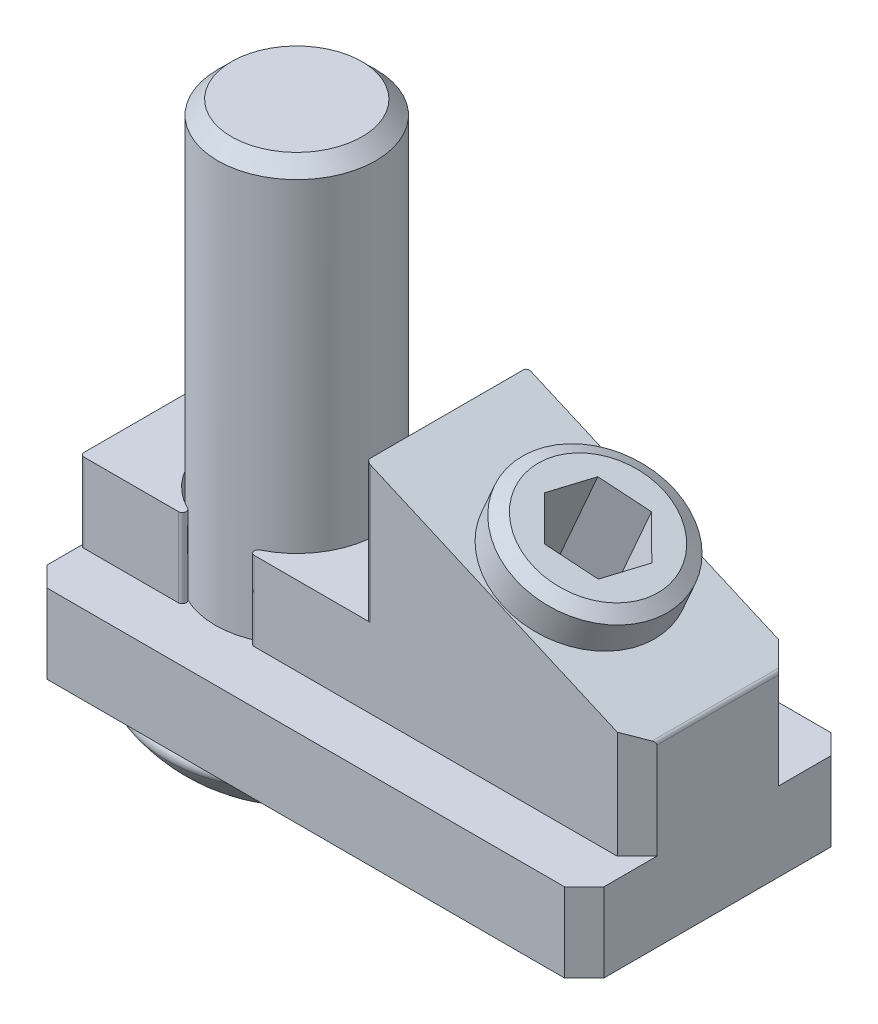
ISO-10303-21;
HEADER;
FILE_DESCRIPTION(('STEP AP214'),'2;1');
FILE_NAME('part.step','',(''),(''),'','','');
FILE_SCHEMA(('AUTOMOTIVE_DESIGN { 1 0 10303 214 1 1 1 1 }'));
ENDSEC;
DATA;
#1=APPLICATION_CONTEXT('core data for automotive mechanical design processes');
#2=APPLICATION_PROTOCOL_DEFINITION('international standard','automotive_design',2000,#1);
#3=PRODUCT_CONTEXT('',#1,'mechanical');
#4=PRODUCT('Part','Part','',(#3));
#5=PRODUCT_RELATED_PRODUCT_CATEGORY('part','',(#4));
#6=PRODUCT_DEFINITION_FORMATION('','',#4);
#7=PRODUCT_DEFINITION_CONTEXT('part definition',#1,'design');
#8=PRODUCT_DEFINITION('design','',#6,#7);
#9=PRODUCT_DEFINITION_SHAPE('','',#8);
#10=(LENGTH_UNIT() NAMED_UNIT(*) SI_UNIT(.MILLI.,.METRE.));
#11=(NAMED_UNIT(*) PLANE_ANGLE_UNIT() SI_UNIT($,.RADIAN.));
#12=(NAMED_UNIT(*) SI_UNIT($,.STERADIAN.) SOLID_ANGLE_UNIT());
#13=UNCERTAINTY_MEASURE_WITH_UNIT(LENGTH_MEASURE(1.E-05),#10,'distance_accuracy_value','');
#14=(GEOMETRIC_REPRESENTATION_CONTEXT(3) GLOBAL_UNCERTAINTY_ASSIGNED_CONTEXT((#13)) GLOBAL_UNIT_ASSIGNED_CONTEXT((#10,
#11,#12)) REPRESENTATION_CONTEXT('',''));
#15=CARTESIAN_POINT('',(0.,0.,0.));
#16=DIRECTION('',(0.,0.,1.));
#17=DIRECTION('',(1.,0.,0.));
#18=AXIS2_PLACEMENT_3D('',#15,#16,#17);
#19=CARTESIAN_POINT('',(0.400000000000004,8.,4.075));
#20=DIRECTION('',(0.,-1.,0.));
#21=DIRECTION('',(1.,0.,0.));
#22=AXIS2_PLACEMENT_3D('',#19,#20,#21);
#23=PLANE('',#22);
#24=DIRECTION('',(-1.,0.,0.));
#25=VECTOR('',#24,1.);
#26=CARTESIAN_POINT('',(0.400000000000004,8.,-4.075));
#27=LINE('',#26,#25);
#28=CARTESIAN_POINT('',(-9.12093727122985,8.,-4.075));
#29=VERTEX_POINT('',#28);
#30=CARTESIAN_POINT('',(-13.9,8.,-4.075));
#31=VERTEX_POINT('',#30);
#32=EDGE_CURVE('P0_E328',#29,#31,#27,.T.);
#33=ORIENTED_EDGE('',*,*,#32,.T.);
#34=CARTESIAN_POINT('',(-13.9,8.,-3.875));
#35=DIRECTION('',(0.,-1.,0.));
#36=DIRECTION('',(1.,0.,0.));
#37=AXIS2_PLACEMENT_3D('',#34,#35,#36);
#38=CIRCLE('',#37,0.2);
#39=CARTESIAN_POINT('',(-14.1,8.,-3.875));
#40=VERTEX_POINT('',#39);
#41=EDGE_CURVE('P0_E559',#31,#40,#38,.F.);
#42=ORIENTED_EDGE('',*,*,#41,.T.);
#43=DIRECTION('',(0.,0.,-1.));
#44=VECTOR('',#43,1.);
#45=CARTESIAN_POINT('',(-14.1,8.,4.075));
#46=LINE('',#45,#44);
#47=CARTESIAN_POINT('',(-14.1,8.,3.875));
#48=VERTEX_POINT('',#47);
#49=EDGE_CURVE('P0_E320',#48,#40,#46,.T.);
#50=ORIENTED_EDGE('',*,*,#49,.F.);
#51=CARTESIAN_POINT('',(-13.9,8.,3.875));
#52=DIRECTION('',(0.,-1.,0.));
#53=DIRECTION('',(1.,0.,0.));
#54=AXIS2_PLACEMENT_3D('',#51,#52,#53);
#55=CIRCLE('',#54,0.2);
#56=CARTESIAN_POINT('',(-13.9,8.,4.075));
#57=VERTEX_POINT('',#56);
#58=EDGE_CURVE('P0_E556',#48,#57,#55,.F.);
#59=ORIENTED_EDGE('',*,*,#58,.T.);
#60=DIRECTION('',(-1.,0.,0.));
#61=VECTOR('',#60,1.);
#62=CARTESIAN_POINT('',(0.400000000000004,8.,4.075));
#63=LINE('',#62,#61);
#64=CARTESIAN_POINT('',(-9.12093727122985,8.,4.075));
#65=VERTEX_POINT('',#64);
#66=EDGE_CURVE('P0_E315',#65,#57,#63,.T.);
#67=ORIENTED_EDGE('',*,*,#66,.F.);
#68=CARTESIAN_POINT('',(-9.12093727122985,8.,3.875));
#69=DIRECTION('',(0.,-1.,0.));
#70=DIRECTION('',(1.,0.,0.));
#71=AXIS2_PLACEMENT_3D('',#68,#69,#70);
#72=CIRCLE('',#71,0.2);
#73=CARTESIAN_POINT('',(-9.03210780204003,8.,3.69580924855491));
#74=VERTEX_POINT('',#73);
#75=EDGE_CURVE('P0_E398',#65,#74,#72,.F.);
#76=ORIENTED_EDGE('',*,*,#75,.T.);
#77=CARTESIAN_POINT('',(-7.2,8.,0.));
#78=DIRECTION('',(0.,1.,0.));
#79=DIRECTION('',(-1.,0.,0.));
#80=AXIS2_PLACEMENT_3D('',#77,#78,#79);
#81=CIRCLE('',#80,4.125);
#82=CARTESIAN_POINT('',(-9.03210780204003,8.,-3.69580924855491));
#83=VERTEX_POINT('',#82);
#84=EDGE_CURVE('P0_E291',#83,#74,#81,.T.);
#85=ORIENTED_EDGE('',*,*,#84,.F.);
#86=CARTESIAN_POINT('',(-9.12093727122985,8.,-3.875));
#87=DIRECTION('',(0.,-1.,0.));
#88=DIRECTION('',(1.,0.,0.));
#89=AXIS2_PLACEMENT_3D('',#86,#87,#88);
#90=CIRCLE('',#89,0.2);
#91=EDGE_CURVE('P0_E395',#83,#29,#90,.F.);
#92=ORIENTED_EDGE('',*,*,#91,.T.);
#93=EDGE_LOOP('',(#33,#42,#50,#59,#67,#76,#85,#92));
#94=FACE_BOUND('',#93,.T.);
#95=ADVANCED_FACE('P0_F16',(#94),#23,.F.);
#96=CARTESIAN_POINT('',(0.,0.,4.075));
#97=DIRECTION('',(0.,0.,1.));
#98=DIRECTION('',(1.,0.,0.));
#99=AXIS2_PLACEMENT_3D('',#96,#97,#98);
#100=PLANE('',#99);
#101=DIRECTION('',(-0.916003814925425,0.401169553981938,0.));
#102=VECTOR('',#101,1.);
#103=CARTESIAN_POINT('',(14.1,9.,4.075));
#104=LINE('',#103,#102);
#105=CARTESIAN_POINT('',(13.1,9.43795620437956,4.075));
#106=VERTEX_POINT('',#105);
#107=CARTESIAN_POINT('',(0.600000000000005,14.9124087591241,4.075));
#108=VERTEX_POINT('',#107);
#109=EDGE_CURVE('P0_E310',#106,#108,#104,.T.);
#110=ORIENTED_EDGE('',*,*,#109,.T.);
#111=DIRECTION('',(0.,-1.,0.));
#112=VECTOR('',#111,1.);
#113=CARTESIAN_POINT('',(0.600000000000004,8.,4.075));
#114=LINE('',#113,#112);
#115=CARTESIAN_POINT('',(0.600000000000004,8.,4.075));
#116=VERTEX_POINT('',#115);
#117=EDGE_CURVE('P0_E542',#108,#116,#114,.T.);
#118=ORIENTED_EDGE('',*,*,#117,.T.);
#119=CARTESIAN_POINT('',(-5.27906272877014,8.,4.075));
#120=VERTEX_POINT('',#119);
#121=EDGE_CURVE('P0_E316',#116,#120,#63,.T.);
#122=ORIENTED_EDGE('',*,*,#121,.T.);
#123=DIRECTION('',(0.,-1.,0.));
#124=VECTOR('',#123,1.);
#125=CARTESIAN_POINT('',(-5.27906272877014,4.,4.075));
#126=LINE('',#125,#124);
#127=CARTESIAN_POINT('',(-5.27906272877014,4.,4.075));
#128=VERTEX_POINT('',#127);
#129=EDGE_CURVE('P0_E407',#120,#128,#126,.T.);
#130=ORIENTED_EDGE('',*,*,#129,.T.);
#131=DIRECTION('',(1.,0.,0.));
#132=VECTOR('',#131,1.);
#133=CARTESIAN_POINT('',(-14.1,4.,4.075));
#134=LINE('',#133,#132);
#135=CARTESIAN_POINT('',(13.1,4.,4.075));
#136=VERTEX_POINT('',#135);
#137=EDGE_CURVE('P0_E311',#128,#136,#134,.T.);
#138=ORIENTED_EDGE('',*,*,#137,.T.);
#139=DIRECTION('',(0.,1.,0.));
#140=VECTOR('',#139,1.);
#141=CARTESIAN_POINT('',(13.1,9.,4.075));
#142=LINE('',#141,#140);
#143=EDGE_CURVE('P0_E502',#136,#106,#142,.T.);
#144=ORIENTED_EDGE('',*,*,#143,.T.);
#145=EDGE_LOOP('',(#110,#118,#122,#130,#138,#144));
#146=FACE_BOUND('',#145,.T.);
#147=ADVANCED_FACE('P0_F685',(#146),#100,.T.);
#148=CARTESIAN_POINT('',(0.,0.,-4.075));
#149=DIRECTION('',(0.,0.,1.));
#150=DIRECTION('',(1.,0.,0.));
#151=AXIS2_PLACEMENT_3D('',#148,#149,#150);
#152=PLANE('',#151);
#153=CARTESIAN_POINT('',(0.600000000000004,8.,-4.075));
#154=VERTEX_POINT('',#153);
#155=CARTESIAN_POINT('',(-5.27906272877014,8.,-4.075));
#156=VERTEX_POINT('',#155);
#157=EDGE_CURVE('P0_E329',#154,#156,#27,.T.);
#158=ORIENTED_EDGE('',*,*,#157,.F.);
#159=DIRECTION('',(0.,-1.,0.));
#160=VECTOR('',#159,1.);
#161=CARTESIAN_POINT('',(0.600000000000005,0.,-4.075));
#162=LINE('',#161,#160);
#163=CARTESIAN_POINT('',(0.600000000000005,14.9124087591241,-4.075));
#164=VERTEX_POINT('',#163);
#165=EDGE_CURVE('P0_E539',#154,#164,#162,.F.);
#166=ORIENTED_EDGE('',*,*,#165,.T.);
#167=DIRECTION('',(-0.916003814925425,0.401169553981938,0.));
#168=VECTOR('',#167,1.);
#169=CARTESIAN_POINT('',(14.1,9.,-4.075));
#170=LINE('',#169,#168);
#171=CARTESIAN_POINT('',(13.1,9.43795620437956,-4.075));
#172=VERTEX_POINT('',#171);
#173=EDGE_CURVE('P0_E324',#172,#164,#170,.T.);
#174=ORIENTED_EDGE('',*,*,#173,.F.);
#175=DIRECTION('',(0.,-1.,0.));
#176=VECTOR('',#175,1.);
#177=CARTESIAN_POINT('',(13.1,0.,-4.075));
#178=LINE('',#177,#176);
#179=CARTESIAN_POINT('',(13.1,4.,-4.075));
#180=VERTEX_POINT('',#179);
#181=EDGE_CURVE('P0_E499',#172,#180,#178,.T.);
#182=ORIENTED_EDGE('',*,*,#181,.T.);
#183=DIRECTION('',(1.,0.,0.));
#184=VECTOR('',#183,1.);
#185=CARTESIAN_POINT('',(-14.1,4.,-4.075));
#186=LINE('',#185,#184);
#187=CARTESIAN_POINT('',(-5.27906272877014,4.,-4.075));
#188=VERTEX_POINT('',#187);
#189=EDGE_CURVE('P0_E306',#188,#180,#186,.T.);
#190=ORIENTED_EDGE('',*,*,#189,.F.);
#191=DIRECTION('',(0.,1.,0.));
#192=VECTOR('',#191,1.);
#193=CARTESIAN_POINT('',(-5.27906272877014,0.,-4.075));
#194=LINE('',#193,#192);
#195=EDGE_CURVE('P0_E414',#188,#156,#194,.T.);
#196=ORIENTED_EDGE('',*,*,#195,.T.);
#197=EDGE_LOOP('',(#158,#166,#174,#182,#190,#196));
#198=FACE_BOUND('',#197,.T.);
#199=ADVANCED_FACE('P0_F625',(#198),#152,.F.);
#200=CARTESIAN_POINT('',(0.,4.,0.));
#201=DIRECTION('',(0.,-1.,0.));
#202=DIRECTION('',(0.,0.,-1.));
#203=AXIS2_PLACEMENT_3D('',#200,#201,#202);
#204=PLANE('',#203);
#205=DIRECTION('',(0.,0.,1.));
#206=VECTOR('',#205,1.);
#207=CARTESIAN_POINT('',(-14.1,4.,6.75));
#208=LINE('',#207,#206);
#209=CARTESIAN_POINT('',(-14.1,4.,3.875));
#210=VERTEX_POINT('',#209);
#211=CARTESIAN_POINT('',(-14.1,4.,5.75));
#212=VERTEX_POINT('',#211);
#213=EDGE_CURVE('P0_E354',#210,#212,#208,.T.);
#214=ORIENTED_EDGE('',*,*,#213,.T.);
#215=DIRECTION('',(-0.707106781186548,0.,-0.707106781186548));
#216=VECTOR('',#215,1.);
#217=CARTESIAN_POINT('',(-13.1,4.,6.75));
#218=LINE('',#217,#216);
#219=CARTESIAN_POINT('',(-13.1,4.,6.75));
#220=VERTEX_POINT('',#219);
#221=EDGE_CURVE('P0_E475',#212,#220,#218,.F.);
#222=ORIENTED_EDGE('',*,*,#221,.T.);
#223=DIRECTION('',(1.,0.,0.));
#224=VECTOR('',#223,1.);
#225=CARTESIAN_POINT('',(-14.1,4.,6.75));
#226=LINE('',#225,#224);
#227=CARTESIAN_POINT('',(13.1,4.,6.75));
#228=VERTEX_POINT('',#227);
#229=EDGE_CURVE('P0_E358',#220,#228,#226,.T.);
#230=ORIENTED_EDGE('',*,*,#229,.T.);
#231=DIRECTION('',(-0.707106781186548,0.,0.707106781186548));
#232=VECTOR('',#231,1.);
#233=CARTESIAN_POINT('',(14.1,4.,5.75));
#234=LINE('',#233,#232);
#235=CARTESIAN_POINT('',(14.1,4.,5.75));
#236=VERTEX_POINT('',#235);
#237=EDGE_CURVE('P0_E472',#228,#236,#234,.F.);
#238=ORIENTED_EDGE('',*,*,#237,.T.);
#239=DIRECTION('',(0.,0.,-1.));
#240=VECTOR('',#239,1.);
#241=CARTESIAN_POINT('',(14.1,4.,6.75));
#242=LINE('',#241,#240);
#243=CARTESIAN_POINT('',(14.1,4.,3.075));
#244=VERTEX_POINT('',#243);
#245=EDGE_CURVE('P0_E345',#236,#244,#242,.T.);
#246=ORIENTED_EDGE('',*,*,#245,.T.);
#247=DIRECTION('',(-0.707106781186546,0.,0.707106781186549));
#248=VECTOR('',#247,1.);
#249=CARTESIAN_POINT('',(8.58750000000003,4.,8.5875));
#250=LINE('',#249,#248);
#251=EDGE_CURVE('P0_E510',#244,#136,#250,.T.);
#252=ORIENTED_EDGE('',*,*,#251,.T.);
#253=ORIENTED_EDGE('',*,*,#137,.F.);
#254=CARTESIAN_POINT('',(-5.27906272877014,4.,3.875));
#255=DIRECTION('',(0.,-1.,0.));
#256=DIRECTION('',(0.,0.,-1.));
#257=AXIS2_PLACEMENT_3D('',#254,#255,#256);
#258=CIRCLE('',#257,0.2);
#259=CARTESIAN_POINT('',(-5.36789219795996,4.,3.69580924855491));
#260=VERTEX_POINT('',#259);
#261=EDGE_CURVE('P0_E422',#128,#260,#258,.T.);
#262=ORIENTED_EDGE('',*,*,#261,.T.);
#263=CARTESIAN_POINT('',(-7.2,4.,0.));
#264=DIRECTION('',(0.,-1.,0.));
#265=DIRECTION('',(0.,0.,-1.));
#266=AXIS2_PLACEMENT_3D('',#263,#264,#265);
#267=CIRCLE('',#266,4.125);
#268=CARTESIAN_POINT('',(-9.03210780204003,4.,3.69580924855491));
#269=VERTEX_POINT('',#268);
#270=EDGE_CURVE('P0_E303',#260,#269,#267,.T.);
#271=ORIENTED_EDGE('',*,*,#270,.T.);
#272=CARTESIAN_POINT('',(-9.12093727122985,4.,3.875));
#273=DIRECTION('',(0.,-1.,0.));
#274=DIRECTION('',(0.,0.,-1.));
#275=AXIS2_PLACEMENT_3D('',#272,#273,#274);
#276=CIRCLE('',#275,0.2);
#277=CARTESIAN_POINT('',(-9.12093727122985,4.,4.075));
#278=VERTEX_POINT('',#277);
#279=EDGE_CURVE('P0_E418',#269,#278,#276,.T.);
#280=ORIENTED_EDGE('',*,*,#279,.T.);
#281=CARTESIAN_POINT('',(-13.9,4.,4.075));
#282=VERTEX_POINT('',#281);
#283=EDGE_CURVE('P0_E307',#282,#278,#134,.T.);
#284=ORIENTED_EDGE('',*,*,#283,.F.);
#285=CARTESIAN_POINT('',(-13.9,4.,3.875));
#286=DIRECTION('',(0.,-1.,0.));
#287=DIRECTION('',(0.,0.,-1.));
#288=AXIS2_PLACEMENT_3D('',#285,#286,#287);
#289=CIRCLE('',#288,0.2);
#290=EDGE_CURVE('P0_E10',#282,#210,#289,.T.);
#291=ORIENTED_EDGE('',*,*,#290,.T.);
#292=EDGE_LOOP('',(#214,#222,#230,#238,#246,#252,#253,#262,#271,#280,#284,#291));
#293=FACE_BOUND('',#292,.T.);
#294=ADVANCED_FACE('P0_F660',(#293),#204,.F.);
#295=CARTESIAN_POINT('',(14.1,4.,6.75));
#296=DIRECTION('',(-1.,0.,0.));
#297=DIRECTION('',(0.,0.,1.));
#298=AXIS2_PLACEMENT_3D('',#295,#296,#297);
#299=PLANE('',#298);
#300=DIRECTION('',(0.,1.,0.));
#301=VECTOR('',#300,1.);
#302=CARTESIAN_POINT('',(14.1,4.,-3.075));
#303=LINE('',#302,#301);
#304=CARTESIAN_POINT('',(14.1,4.,-3.075));
#305=VERTEX_POINT('',#304);
#306=CARTESIAN_POINT('',(14.1,8.86925153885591,-3.075));
#307=VERTEX_POINT('',#306);
#308=EDGE_CURVE('P0_E488',#305,#307,#303,.T.);
#309=ORIENTED_EDGE('',*,*,#308,.T.);
#310=DIRECTION('',(0.,0.,-1.));
#311=VECTOR('',#310,1.);
#312=CARTESIAN_POINT('',(14.1,8.86925153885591,6.75));
#313=LINE('',#312,#311);
#314=CARTESIAN_POINT('',(14.1,8.86925153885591,3.075));
#315=VERTEX_POINT('',#314);
#316=EDGE_CURVE('P0_E526',#307,#315,#313,.F.);
#317=ORIENTED_EDGE('',*,*,#316,.T.);
#318=DIRECTION('',(0.,-1.,0.));
#319=VECTOR('',#318,1.);
#320=CARTESIAN_POINT('',(14.1,4.,3.075));
#321=LINE('',#320,#319);
#322=EDGE_CURVE('P0_E478',#315,#244,#321,.T.);
#323=ORIENTED_EDGE('',*,*,#322,.T.);
#324=ORIENTED_EDGE('',*,*,#245,.F.);
#325=DIRECTION('',(0.,-1.,0.));
#326=VECTOR('',#325,1.);
#327=CARTESIAN_POINT('',(14.1,4.,5.75));
#328=LINE('',#327,#326);
#329=CARTESIAN_POINT('',(14.1,0.,5.75));
#330=VERTEX_POINT('',#329);
#331=EDGE_CURVE('P0_E481',#236,#330,#328,.T.);
#332=ORIENTED_EDGE('',*,*,#331,.T.);
#333=DIRECTION('',(0.,0.,-1.));
#334=VECTOR('',#333,1.);
#335=CARTESIAN_POINT('',(14.1,0.,6.75));
#336=LINE('',#335,#334);
#337=CARTESIAN_POINT('',(14.1,0.,-5.75));
#338=VERTEX_POINT('',#337);
#339=EDGE_CURVE('P0_E344',#330,#338,#336,.T.);
#340=ORIENTED_EDGE('',*,*,#339,.T.);
#341=DIRECTION('',(0.,1.,0.));
#342=VECTOR('',#341,1.);
#343=CARTESIAN_POINT('',(14.1,4.,-5.75));
#344=LINE('',#343,#342);
#345=CARTESIAN_POINT('',(14.1,4.,-5.75));
#346=VERTEX_POINT('',#345);
#347=EDGE_CURVE('P0_E485',#338,#346,#344,.T.);
#348=ORIENTED_EDGE('',*,*,#347,.T.);
#349=EDGE_CURVE('P0_E350',#305,#346,#242,.T.);
#350=ORIENTED_EDGE('',*,*,#349,.F.);
#351=EDGE_LOOP('',(#309,#317,#323,#324,#332,#340,#348,#350));
#352=FACE_BOUND('',#351,.T.);
#353=ADVANCED_FACE('P0_F671',(#352),#299,.F.);
#354=CARTESIAN_POINT('',(-14.1,4.,-6.75));
#355=DIRECTION('',(0.,0.,1.));
#356=DIRECTION('',(1.,0.,0.));
#357=AXIS2_PLACEMENT_3D('',#354,#355,#356);
#358=PLANE('',#357);
#359=DIRECTION('',(-1.,0.,0.));
#360=VECTOR('',#359,1.);
#361=CARTESIAN_POINT('',(-14.1,0.,-6.75));
#362=LINE('',#361,#360);
#363=CARTESIAN_POINT('',(13.1,0.,-6.75));
#364=VERTEX_POINT('',#363);
#365=CARTESIAN_POINT('',(-13.1,0.,-6.75));
#366=VERTEX_POINT('',#365);
#367=EDGE_CURVE('P0_E366',#364,#366,#362,.T.);
#368=ORIENTED_EDGE('',*,*,#367,.T.);
#369=DIRECTION('',(0.,1.,0.));
#370=VECTOR('',#369,1.);
#371=CARTESIAN_POINT('',(-13.1,4.,-6.75));
#372=LINE('',#371,#370);
#373=CARTESIAN_POINT('',(-13.1,4.,-6.75));
#374=VERTEX_POINT('',#373);
#375=EDGE_CURVE('P0_E456',#366,#374,#372,.T.);
#376=ORIENTED_EDGE('',*,*,#375,.T.);
#377=DIRECTION('',(-1.,0.,0.));
#378=VECTOR('',#377,1.);
#379=CARTESIAN_POINT('',(-14.1,4.,-6.75));
#380=LINE('',#379,#378);
#381=CARTESIAN_POINT('',(13.1,4.,-6.75));
#382=VERTEX_POINT('',#381);
#383=EDGE_CURVE('P0_E349',#382,#374,#380,.T.);
#384=ORIENTED_EDGE('',*,*,#383,.F.);
#385=DIRECTION('',(0.,-1.,0.));
#386=VECTOR('',#385,1.);
#387=CARTESIAN_POINT('',(13.1,4.,-6.75));
#388=LINE('',#387,#386);
#389=EDGE_CURVE('P0_E452',#382,#364,#388,.T.);
#390=ORIENTED_EDGE('',*,*,#389,.T.);
#391=EDGE_LOOP('',(#368,#376,#384,#390));
#392=FACE_BOUND('',#391,.T.);
#393=ADVANCED_FACE('P0_F643',(#392),#358,.F.);
#394=CARTESIAN_POINT('',(-14.1,4.,6.75));
#395=DIRECTION('',(1.,0.,0.));
#396=DIRECTION('',(0.,0.,-1.));
#397=AXIS2_PLACEMENT_3D('',#394,#395,#396);
#398=PLANE('',#397);
#399=ORIENTED_EDGE('',*,*,#49,.T.);
#400=DIRECTION('',(0.,-1.,0.));
#401=VECTOR('',#400,1.);
#402=CARTESIAN_POINT('',(-14.1,4.,-3.875));
#403=LINE('',#402,#401);
#404=CARTESIAN_POINT('',(-14.1,4.,-3.875));
#405=VERTEX_POINT('',#404);
#406=EDGE_CURVE('P0_E549',#40,#405,#403,.T.);
#407=ORIENTED_EDGE('',*,*,#406,.T.);
#408=CARTESIAN_POINT('',(-14.1,4.,-5.75000000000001));
#409=VERTEX_POINT('',#408);
#410=EDGE_CURVE('P0_E355',#409,#405,#208,.T.);
#411=ORIENTED_EDGE('',*,*,#410,.F.);
#412=DIRECTION('',(0.,-1.,0.));
#413=VECTOR('',#412,1.);
#414=CARTESIAN_POINT('',(-14.1,4.,-5.75000000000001));
#415=LINE('',#414,#413);
#416=CARTESIAN_POINT('',(-14.1,0.,-5.75000000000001));
#417=VERTEX_POINT('',#416);
#418=EDGE_CURVE('P0_E436',#409,#417,#415,.T.);
#419=ORIENTED_EDGE('',*,*,#418,.T.);
#420=DIRECTION('',(0.,0.,1.));
#421=VECTOR('',#420,1.);
#422=CARTESIAN_POINT('',(-14.1,0.,6.75));
#423=LINE('',#422,#421);
#424=CARTESIAN_POINT('',(-14.1,0.,5.75));
#425=VERTEX_POINT('',#424);
#426=EDGE_CURVE('P0_E370',#417,#425,#423,.T.);
#427=ORIENTED_EDGE('',*,*,#426,.T.);
#428=DIRECTION('',(0.,1.,0.));
#429=VECTOR('',#428,1.);
#430=CARTESIAN_POINT('',(-14.1,4.,5.75));
#431=LINE('',#430,#429);
#432=EDGE_CURVE('P0_E433',#425,#212,#431,.T.);
#433=ORIENTED_EDGE('',*,*,#432,.T.);
#434=ORIENTED_EDGE('',*,*,#213,.F.);
#435=DIRECTION('',(0.,-1.,0.));
#436=VECTOR('',#435,1.);
#437=CARTESIAN_POINT('',(-14.1,8.,3.875));
#438=LINE('',#437,#436);
#439=EDGE_CURVE('P0_E546',#210,#48,#438,.F.);
#440=ORIENTED_EDGE('',*,*,#439,.T.);
#441=EDGE_LOOP('',(#399,#407,#411,#419,#427,#433,#434,#440));
#442=FACE_BOUND('',#441,.T.);
#443=ADVANCED_FACE('P0_F592',(#442),#398,.F.);
#444=CARTESIAN_POINT('',(-14.1,4.,6.75));
#445=DIRECTION('',(0.,0.,-1.));
#446=DIRECTION('',(-1.,0.,0.));
#447=AXIS2_PLACEMENT_3D('',#444,#445,#446);
#448=PLANE('',#447);
#449=ORIENTED_EDGE('',*,*,#229,.F.);
#450=DIRECTION('',(0.,-1.,0.));
#451=VECTOR('',#450,1.);
#452=CARTESIAN_POINT('',(-13.1,4.,6.75));
#453=LINE('',#452,#451);
#454=CARTESIAN_POINT('',(-13.1,0.,6.75));
#455=VERTEX_POINT('',#454);
#456=EDGE_CURVE('P0_E468',#220,#455,#453,.T.);
#457=ORIENTED_EDGE('',*,*,#456,.T.);
#458=DIRECTION('',(1.,0.,0.));
#459=VECTOR('',#458,1.);
#460=CARTESIAN_POINT('',(-14.1,0.,6.75));
#461=LINE('',#460,#459);
#462=CARTESIAN_POINT('',(13.1,0.,6.75));
#463=VERTEX_POINT('',#462);
#464=EDGE_CURVE('P0_E374',#455,#463,#461,.T.);
#465=ORIENTED_EDGE('',*,*,#464,.T.);
#466=DIRECTION('',(0.,1.,0.));
#467=VECTOR('',#466,1.);
#468=CARTESIAN_POINT('',(13.1,4.,6.75));
#469=LINE('',#468,#467);
#470=EDGE_CURVE('P0_E465',#463,#228,#469,.T.);
#471=ORIENTED_EDGE('',*,*,#470,.T.);
#472=EDGE_LOOP('',(#449,#457,#465,#471));
#473=FACE_BOUND('',#472,.T.);
#474=ADVANCED_FACE('P0_F663',(#473),#448,.F.);
#475=ORIENTED_EDGE('',*,*,#383,.T.);
#476=DIRECTION('',(0.707106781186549,0.,-0.707106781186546));
#477=VECTOR('',#476,1.);
#478=CARTESIAN_POINT('',(-14.1,4.,-5.75000000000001));
#479=LINE('',#478,#477);
#480=EDGE_CURVE('P0_E462',#374,#409,#479,.F.);
#481=ORIENTED_EDGE('',*,*,#480,.T.);
#482=ORIENTED_EDGE('',*,*,#410,.T.);
#483=CARTESIAN_POINT('',(-13.9,4.,-3.875));
#484=DIRECTION('',(0.,-1.,0.));
#485=DIRECTION('',(0.,0.,-1.));
#486=AXIS2_PLACEMENT_3D('',#483,#484,#485);
#487=CIRCLE('',#486,0.2);
#488=CARTESIAN_POINT('',(-13.9,4.,-4.075));
#489=VERTEX_POINT('',#488);
#490=EDGE_CURVE('P0_E25',#405,#489,#487,.T.);
#491=ORIENTED_EDGE('',*,*,#490,.T.);
#492=CARTESIAN_POINT('',(-9.12093727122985,4.,-4.075));
#493=VERTEX_POINT('',#492);
#494=EDGE_CURVE('P0_E321',#489,#493,#186,.T.);
#495=ORIENTED_EDGE('',*,*,#494,.T.);
#496=CARTESIAN_POINT('',(-9.12093727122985,4.,-3.875));
#497=DIRECTION('',(0.,-1.,0.));
#498=DIRECTION('',(0.,0.,-1.));
#499=AXIS2_PLACEMENT_3D('',#496,#497,#498);
#500=CIRCLE('',#499,0.2);
#501=CARTESIAN_POINT('',(-9.03210780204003,4.,-3.69580924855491));
#502=VERTEX_POINT('',#501);
#503=EDGE_CURVE('P0_E426',#493,#502,#500,.T.);
#504=ORIENTED_EDGE('',*,*,#503,.T.);
#505=CARTESIAN_POINT('',(-7.2,4.,0.));
#506=DIRECTION('',(0.,-1.,0.));
#507=DIRECTION('',(0.,0.,-1.));
#508=AXIS2_PLACEMENT_3D('',#505,#506,#507);
#509=CIRCLE('',#508,4.125);
#510=CARTESIAN_POINT('',(-5.36789219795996,4.,-3.69580924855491));
#511=VERTEX_POINT('',#510);
#512=EDGE_CURVE('P0_E296',#502,#511,#509,.T.);
#513=ORIENTED_EDGE('',*,*,#512,.T.);
#514=CARTESIAN_POINT('',(-5.27906272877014,4.,-3.875));
#515=DIRECTION('',(0.,-1.,0.));
#516=DIRECTION('',(0.,0.,-1.));
#517=AXIS2_PLACEMENT_3D('',#514,#515,#516);
#518=CIRCLE('',#517,0.2);
#519=EDGE_CURVE('P0_E430',#511,#188,#518,.T.);
#520=ORIENTED_EDGE('',*,*,#519,.T.);
#521=ORIENTED_EDGE('',*,*,#189,.T.);
#522=DIRECTION('',(-0.707106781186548,0.,-0.707106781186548));
#523=VECTOR('',#522,1.);
#524=CARTESIAN_POINT('',(8.5875,4.,-8.5875));
#525=LINE('',#524,#523);
#526=EDGE_CURVE('P0_E506',#180,#305,#525,.F.);
#527=ORIENTED_EDGE('',*,*,#526,.T.);
#528=ORIENTED_EDGE('',*,*,#349,.T.);
#529=DIRECTION('',(0.707106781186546,0.,0.707106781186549));
#530=VECTOR('',#529,1.);
#531=CARTESIAN_POINT('',(13.1,4.,-6.75));
#532=LINE('',#531,#530);
#533=EDGE_CURVE('P0_E459',#346,#382,#532,.F.);
#534=ORIENTED_EDGE('',*,*,#533,.T.);
#535=EDGE_LOOP('',(#475,#481,#482,#491,#495,#504,#513,#520,#521,#527,#528,#534));
#536=FACE_BOUND('',#535,.T.);
#537=ADVANCED_FACE('P0_F575',(#536),#204,.F.);
#538=CARTESIAN_POINT('',(0.,0.,0.));
#539=DIRECTION('',(0.,-1.,0.));
#540=DIRECTION('',(0.,0.,-1.));
#541=AXIS2_PLACEMENT_3D('',#538,#539,#540);
#542=PLANE('',#541);
#543=DIRECTION('',(0.,0.,1.));
#544=VECTOR('',#543,1.);
#545=CARTESIAN_POINT('',(13.1,0.,4.45));
#546=LINE('',#545,#544);
#547=CARTESIAN_POINT('',(13.1,0.,-4.45));
#548=VERTEX_POINT('',#547);
#549=CARTESIAN_POINT('',(13.1,0.,4.45));
#550=VERTEX_POINT('',#549);
#551=EDGE_CURVE('P0_E32',#548,#550,#546,.T.);
#552=ORIENTED_EDGE('',*,*,#551,.F.);
#553=DIRECTION('',(1.,0.,0.));
#554=VECTOR('',#553,1.);
#555=CARTESIAN_POINT('',(8.2,0.,-4.45));
#556=LINE('',#555,#554);
#557=CARTESIAN_POINT('',(8.2,0.,-4.45));
#558=VERTEX_POINT('',#557);
#559=EDGE_CURVE('P0_E255',#558,#548,#556,.T.);
#560=ORIENTED_EDGE('',*,*,#559,.F.);
#561=DIRECTION('',(0.,0.,-1.));
#562=VECTOR('',#561,1.);
#563=CARTESIAN_POINT('',(8.2,0.,4.45));
#564=LINE('',#563,#562);
#565=CARTESIAN_POINT('',(8.2,0.,4.45));
#566=VERTEX_POINT('',#565);
#567=EDGE_CURVE('P0_E260',#566,#558,#564,.T.);
#568=ORIENTED_EDGE('',*,*,#567,.F.);
#569=DIRECTION('',(-1.,0.,0.));
#570=VECTOR('',#569,1.);
#571=CARTESIAN_POINT('',(8.2,0.,4.45));
#572=LINE('',#571,#570);
#573=EDGE_CURVE('P0_E269',#550,#566,#572,.T.);
#574=ORIENTED_EDGE('',*,*,#573,.F.);
#575=EDGE_LOOP('',(#552,#560,#568,#574));
#576=FACE_BOUND('',#575,.T.);
#577=CARTESIAN_POINT('',(1.99452554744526,0.,0.));
#578=DIRECTION('',(0.,-1.,0.));
#579=DIRECTION('',(1.,0.,0.));
#580=AXIS2_PLACEMENT_3D('',#577,#578,#579);
#581=ELLIPSE('',#580,3.71177493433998,3.39999999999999);
#582=CARTESIAN_POINT('',(5.70630048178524,0.,0.));
#583=VERTEX_POINT('',#582);
#584=EDGE_CURVE('P0_E287',#583,#583,#581,.T.);
#585=ORIENTED_EDGE('',*,*,#584,.F.);
#586=EDGE_LOOP('',(#585));
#587=FACE_BOUND('',#586,.T.);
#588=CARTESIAN_POINT('',(-7.2,0.,0.));
#589=DIRECTION('',(0.,1.,0.));
#590=DIRECTION('',(-1.,0.,0.));
#591=AXIS2_PLACEMENT_3D('',#588,#589,#590);
#592=CIRCLE('',#591,4.125);
#593=CARTESIAN_POINT('',(-11.325,0.,0.));
#594=VERTEX_POINT('',#593);
#595=EDGE_CURVE('P0_E292',#594,#594,#592,.T.);
#596=ORIENTED_EDGE('',*,*,#595,.T.);
#597=EDGE_LOOP('',(#596));
#598=FACE_BOUND('',#597,.T.);
#599=ORIENTED_EDGE('',*,*,#426,.F.);
#600=DIRECTION('',(-0.707106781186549,0.,0.707106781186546));
#601=VECTOR('',#600,1.);
#602=CARTESIAN_POINT('',(-9.92499999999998,0.,-9.92500000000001));
#603=LINE('',#602,#601);
#604=EDGE_CURVE('P0_E449',#417,#366,#603,.F.);
#605=ORIENTED_EDGE('',*,*,#604,.T.);
#606=ORIENTED_EDGE('',*,*,#367,.F.);
#607=DIRECTION('',(-0.707106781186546,0.,-0.707106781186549));
#608=VECTOR('',#607,1.);
#609=CARTESIAN_POINT('',(9.92500000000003,0.,-9.925));
#610=LINE('',#609,#608);
#611=EDGE_CURVE('P0_E443',#364,#338,#610,.F.);
#612=ORIENTED_EDGE('',*,*,#611,.T.);
#613=ORIENTED_EDGE('',*,*,#339,.F.);
#614=DIRECTION('',(0.707106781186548,0.,-0.707106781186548));
#615=VECTOR('',#614,1.);
#616=CARTESIAN_POINT('',(9.925,0.,9.925));
#617=LINE('',#616,#615);
#618=EDGE_CURVE('P0_E440',#330,#463,#617,.F.);
#619=ORIENTED_EDGE('',*,*,#618,.T.);
#620=ORIENTED_EDGE('',*,*,#464,.F.);
#621=DIRECTION('',(0.707106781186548,0.,0.707106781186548));
#622=VECTOR('',#621,1.);
#623=CARTESIAN_POINT('',(-9.925,0.,9.925));
#624=LINE('',#623,#622);
#625=EDGE_CURVE('P0_E446',#455,#425,#624,.F.);
#626=ORIENTED_EDGE('',*,*,#625,.T.);
#627=EDGE_LOOP('',(#599,#605,#606,#612,#613,#619,#620,#626));
#628=FACE_BOUND('',#627,.T.);
#629=ADVANCED_FACE('P0_F647',(#576,#587,#598,#628),#542,.T.);
#630=CARTESIAN_POINT('',(14.1,9.,4.075));
#631=DIRECTION('',(-0.401169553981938,-0.916003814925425,0.));
#632=DIRECTION('',(0.916003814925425,-0.401169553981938,0.));
#633=AXIS2_PLACEMENT_3D('',#630,#631,#632);
#634=PLANE('',#633);
#635=CARTESIAN_POINT('',(7.25000000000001,12.,0.));
#636=DIRECTION('',(0.401169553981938,0.916003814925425,0.));
#637=DIRECTION('',(-0.916003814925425,0.401169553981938,0.));
#638=AXIS2_PLACEMENT_3D('',#635,#636,#637);
#639=CIRCLE('',#638,3.39999999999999);
#640=CARTESIAN_POINT('',(4.13558702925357,13.3639764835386,0.));
#641=VERTEX_POINT('',#640);
#642=EDGE_CURVE('P0_E278',#641,#641,#639,.T.);
#643=ORIENTED_EDGE('',*,*,#642,.F.);
#644=EDGE_LOOP('',(#643));
#645=FACE_BOUND('',#644,.T.);
#646=DIRECTION('',(0.675458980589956,-0.295821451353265,-0.675458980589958));
#647=VECTOR('',#646,1.);
#648=CARTESIAN_POINT('',(14.9858476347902,8.61203753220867,2.18915236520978));
#649=LINE('',#648,#647);
#650=CARTESIAN_POINT('',(13.9802339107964,9.052452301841,3.19476608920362));
#651=VERTEX_POINT('',#650);
#652=EDGE_CURVE('P0_E492',#106,#651,#649,.T.);
#653=ORIENTED_EDGE('',*,*,#652,.T.);
#654=DIRECTION('',(0.,0.,-1.));
#655=VECTOR('',#654,1.);
#656=CARTESIAN_POINT('',(13.9802339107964,9.052452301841,4.075));
#657=LINE('',#656,#655);
#658=CARTESIAN_POINT('',(13.9802339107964,9.052452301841,-3.19476608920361));
#659=VERTEX_POINT('',#658);
#660=EDGE_CURVE('P0_E519',#651,#659,#657,.T.);
#661=ORIENTED_EDGE('',*,*,#660,.T.);
#662=DIRECTION('',(0.675458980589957,-0.295821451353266,0.675458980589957));
#663=VECTOR('',#662,1.);
#664=CARTESIAN_POINT('',(15.0990762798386,8.56244834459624,-2.07592372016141));
#665=LINE('',#664,#663);
#666=EDGE_CURVE('P0_E496',#659,#172,#665,.F.);
#667=ORIENTED_EDGE('',*,*,#666,.T.);
#668=ORIENTED_EDGE('',*,*,#173,.T.);
#669=CARTESIAN_POINT('',(0.600000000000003,14.9124087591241,-3.875));
#670=DIRECTION('',(-0.401169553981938,-0.916003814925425,0.));
#671=DIRECTION('',(0.916003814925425,-0.401169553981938,0.));
#672=AXIS2_PLACEMENT_3D('',#669,#670,#671);
#673=ELLIPSE('',#672,0.218339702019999,0.2);
#674=CARTESIAN_POINT('',(0.400000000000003,15.,-3.875));
#675=VERTEX_POINT('',#674);
#676=EDGE_CURVE('P0_E516',#164,#675,#673,.F.);
#677=ORIENTED_EDGE('',*,*,#676,.T.);
#678=DIRECTION('',(0.,0.,-1.));
#679=VECTOR('',#678,1.);
#680=CARTESIAN_POINT('',(0.400000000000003,15.,4.075));
#681=LINE('',#680,#679);
#682=CARTESIAN_POINT('',(0.400000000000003,15.,3.875));
#683=VERTEX_POINT('',#682);
#684=EDGE_CURVE('P0_E340',#683,#675,#681,.T.);
#685=ORIENTED_EDGE('',*,*,#684,.F.);
#686=CARTESIAN_POINT('',(0.600000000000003,14.9124087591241,3.875));
#687=DIRECTION('',(-0.401169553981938,-0.916003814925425,0.));
#688=DIRECTION('',(-0.916003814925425,0.401169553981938,0.));
#689=AXIS2_PLACEMENT_3D('',#686,#687,#688);
#690=ELLIPSE('',#689,0.218339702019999,0.2);
#691=EDGE_CURVE('P0_E513',#683,#108,#690,.F.);
#692=ORIENTED_EDGE('',*,*,#691,.T.);
#693=ORIENTED_EDGE('',*,*,#109,.F.);
#694=EDGE_LOOP('',(#653,#661,#667,#668,#677,#685,#692,#693));
#695=FACE_BOUND('',#694,.T.);
#696=ADVANCED_FACE('P0_F682',(#645,#695),#634,.F.);
#697=CARTESIAN_POINT('',(0.400000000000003,15.,4.075));
#698=DIRECTION('',(1.,0.,0.));
#699=DIRECTION('',(0.,1.,0.));
#700=AXIS2_PLACEMENT_3D('',#697,#698,#699);
#701=PLANE('',#700);
#702=ORIENTED_EDGE('',*,*,#684,.T.);
#703=DIRECTION('',(0.,-1.,0.));
#704=VECTOR('',#703,1.);
#705=CARTESIAN_POINT('',(0.400000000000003,15.,-3.875));
#706=LINE('',#705,#704);
#707=CARTESIAN_POINT('',(0.400000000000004,8.,-3.875));
#708=VERTEX_POINT('',#707);
#709=EDGE_CURVE('P0_E535',#675,#708,#706,.T.);
#710=ORIENTED_EDGE('',*,*,#709,.T.);
#711=DIRECTION('',(0.,0.,-1.));
#712=VECTOR('',#711,1.);
#713=CARTESIAN_POINT('',(0.400000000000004,8.,4.075));
#714=LINE('',#713,#712);
#715=CARTESIAN_POINT('',(0.400000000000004,8.,3.875));
#716=VERTEX_POINT('',#715);
#717=EDGE_CURVE('P0_E336',#716,#708,#714,.T.);
#718=ORIENTED_EDGE('',*,*,#717,.F.);
#719=DIRECTION('',(0.,-1.,0.));
#720=VECTOR('',#719,1.);
#721=CARTESIAN_POINT('',(0.400000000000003,15.,3.875));
#722=LINE('',#721,#720);
#723=EDGE_CURVE('P0_E532',#716,#683,#722,.F.);
#724=ORIENTED_EDGE('',*,*,#723,.T.);
#725=EDGE_LOOP('',(#702,#710,#718,#724));
#726=FACE_BOUND('',#725,.T.);
#727=ADVANCED_FACE('P0_F700',(#726),#701,.F.);
#728=CARTESIAN_POINT('',(-5.36789219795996,8.,3.69580924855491));
#729=VERTEX_POINT('',#728);
#730=CARTESIAN_POINT('',(-5.36789219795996,8.,-3.69580924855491));
#731=VERTEX_POINT('',#730);
#732=EDGE_CURVE('P0_E297',#729,#731,#81,.T.);
#733=ORIENTED_EDGE('',*,*,#732,.F.);
#734=CARTESIAN_POINT('',(-5.27906272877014,8.,3.875));
#735=DIRECTION('',(0.,-1.,0.));
#736=DIRECTION('',(1.,0.,0.));
#737=AXIS2_PLACEMENT_3D('',#734,#735,#736);
#738=CIRCLE('',#737,0.2);
#739=EDGE_CURVE('P0_E404',#729,#120,#738,.F.);
#740=ORIENTED_EDGE('',*,*,#739,.T.);
#741=ORIENTED_EDGE('',*,*,#121,.F.);
#742=CARTESIAN_POINT('',(0.600000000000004,8.,3.875));
#743=DIRECTION('',(0.,-1.,0.));
#744=DIRECTION('',(1.,0.,0.));
#745=AXIS2_PLACEMENT_3D('',#742,#743,#744);
#746=CIRCLE('',#745,0.2);
#747=EDGE_CURVE('P0_E569',#116,#716,#746,.T.);
#748=ORIENTED_EDGE('',*,*,#747,.T.);
#749=ORIENTED_EDGE('',*,*,#717,.T.);
#750=CARTESIAN_POINT('',(0.600000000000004,8.,-3.875));
#751=DIRECTION('',(0.,-1.,0.));
#752=DIRECTION('',(1.,0.,0.));
#753=AXIS2_PLACEMENT_3D('',#750,#751,#752);
#754=CIRCLE('',#753,0.2);
#755=EDGE_CURVE('P0_E565',#708,#154,#754,.T.);
#756=ORIENTED_EDGE('',*,*,#755,.T.);
#757=ORIENTED_EDGE('',*,*,#157,.T.);
#758=CARTESIAN_POINT('',(-5.27906272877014,8.,-3.875));
#759=DIRECTION('',(0.,-1.,0.));
#760=DIRECTION('',(1.,0.,0.));
#761=AXIS2_PLACEMENT_3D('',#758,#759,#760);
#762=CIRCLE('',#761,0.2);
#763=EDGE_CURVE('P0_E401',#156,#731,#762,.F.);
#764=ORIENTED_EDGE('',*,*,#763,.T.);
#765=EDGE_LOOP('',(#733,#740,#741,#748,#749,#756,#757,#764));
#766=FACE_BOUND('',#765,.T.);
#767=ADVANCED_FACE('P0_F692',(#766),#23,.F.);
#768=ORIENTED_EDGE('',*,*,#66,.T.);
#769=DIRECTION('',(0.,-1.,0.));
#770=VECTOR('',#769,1.);
#771=CARTESIAN_POINT('',(-13.9,4.,4.075));
#772=LINE('',#771,#770);
#773=EDGE_CURVE('P0_E562',#57,#282,#772,.T.);
#774=ORIENTED_EDGE('',*,*,#773,.T.);
#775=ORIENTED_EDGE('',*,*,#283,.T.);
#776=DIRECTION('',(0.,-1.,0.));
#777=VECTOR('',#776,1.);
#778=CARTESIAN_POINT('',(-9.12093727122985,8.,4.075));
#779=LINE('',#778,#777);
#780=EDGE_CURVE('P0_E392',#278,#65,#779,.F.);
#781=ORIENTED_EDGE('',*,*,#780,.T.);
#782=EDGE_LOOP('',(#768,#774,#775,#781));
#783=FACE_BOUND('',#782,.T.);
#784=ADVANCED_FACE('P0_F598',(#783),#100,.T.);
#785=ORIENTED_EDGE('',*,*,#494,.F.);
#786=DIRECTION('',(0.,-1.,0.));
#787=VECTOR('',#786,1.);
#788=CARTESIAN_POINT('',(-13.9,0.,-4.075));
#789=LINE('',#788,#787);
#790=EDGE_CURVE('P0_E553',#489,#31,#789,.F.);
#791=ORIENTED_EDGE('',*,*,#790,.T.);
#792=ORIENTED_EDGE('',*,*,#32,.F.);
#793=DIRECTION('',(0.,1.,0.));
#794=VECTOR('',#793,1.);
#795=CARTESIAN_POINT('',(-9.12093727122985,0.,-4.075));
#796=LINE('',#795,#794);
#797=EDGE_CURVE('P0_E410',#29,#493,#796,.F.);
#798=ORIENTED_EDGE('',*,*,#797,.T.);
#799=EDGE_LOOP('',(#785,#791,#792,#798));
#800=FACE_BOUND('',#799,.T.);
#801=ADVANCED_FACE('P0_F582',(#800),#152,.F.);
#802=CARTESIAN_POINT('',(-7.2,0.,0.));
#803=DIRECTION('',(0.,1.,0.));
#804=DIRECTION('',(-1.,0.,0.));
#805=AXIS2_PLACEMENT_3D('',#802,#803,#804);
#806=CYLINDRICAL_SURFACE('',#805,4.125);
#807=ORIENTED_EDGE('',*,*,#84,.T.);
#808=DIRECTION('',(0.,1.,0.));
#809=VECTOR('',#808,1.);
#810=CARTESIAN_POINT('',(-9.03210780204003,0.,3.69580924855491));
#811=LINE('',#810,#809);
#812=EDGE_CURVE('P0_E388',#74,#269,#811,.F.);
#813=ORIENTED_EDGE('',*,*,#812,.T.);
#814=ORIENTED_EDGE('',*,*,#270,.F.);
#815=DIRECTION('',(0.,1.,0.));
#816=VECTOR('',#815,1.);
#817=CARTESIAN_POINT('',(-5.36789219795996,0.,3.69580924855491));
#818=LINE('',#817,#816);
#819=EDGE_CURVE('P0_E384',#260,#729,#818,.T.);
#820=ORIENTED_EDGE('',*,*,#819,.T.);
#821=ORIENTED_EDGE('',*,*,#732,.T.);
#822=DIRECTION('',(0.,1.,0.));
#823=VECTOR('',#822,1.);
#824=CARTESIAN_POINT('',(-5.36789219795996,0.,-3.69580924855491));
#825=LINE('',#824,#823);
#826=EDGE_CURVE('P0_E362',#731,#511,#825,.F.);
#827=ORIENTED_EDGE('',*,*,#826,.T.);
#828=ORIENTED_EDGE('',*,*,#512,.F.);
#829=DIRECTION('',(0.,1.,0.));
#830=VECTOR('',#829,1.);
#831=CARTESIAN_POINT('',(-9.03210780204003,0.,-3.69580924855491));
#832=LINE('',#831,#830);
#833=EDGE_CURVE('P0_E381',#502,#83,#832,.T.);
#834=ORIENTED_EDGE('',*,*,#833,.T.);
#835=EDGE_LOOP('',(#807,#813,#814,#820,#821,#827,#828,#834));
#836=FACE_BOUND('',#835,.T.);
#837=ORIENTED_EDGE('',*,*,#595,.F.);
#838=EDGE_LOOP('',(#837));
#839=FACE_BOUND('',#838,.T.);
#840=ADVANCED_FACE('P0_F614',(#836,#839),#806,.F.);
#841=CARTESIAN_POINT('',(-9.12093727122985,0.,3.875));
#842=DIRECTION('',(0.,1.,0.));
#843=DIRECTION('',(-1.,0.,0.));
#844=AXIS2_PLACEMENT_3D('',#841,#842,#843);
#845=CYLINDRICAL_SURFACE('',#844,0.2);
#846=ORIENTED_EDGE('',*,*,#75,.F.);
#847=ORIENTED_EDGE('',*,*,#780,.F.);
#848=ORIENTED_EDGE('',*,*,#279,.F.);
#849=ORIENTED_EDGE('',*,*,#812,.F.);
#850=EDGE_LOOP('',(#846,#847,#848,#849));
#851=FACE_BOUND('',#850,.T.);
#852=ADVANCED_FACE('P0_F748',(#851),#845,.T.);
#853=CARTESIAN_POINT('',(-5.27906272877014,0.,3.875));
#854=DIRECTION('',(0.,1.,0.));
#855=DIRECTION('',(-1.,0.,0.));
#856=AXIS2_PLACEMENT_3D('',#853,#854,#855);
#857=CYLINDRICAL_SURFACE('',#856,0.2);
#858=ORIENTED_EDGE('',*,*,#261,.F.);
#859=ORIENTED_EDGE('',*,*,#129,.F.);
#860=ORIENTED_EDGE('',*,*,#739,.F.);
#861=ORIENTED_EDGE('',*,*,#819,.F.);
#862=EDGE_LOOP('',(#858,#859,#860,#861));
#863=FACE_BOUND('',#862,.T.);
#864=ADVANCED_FACE('P0_F691',(#863),#857,.T.);
#865=CARTESIAN_POINT('',(-9.12093727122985,0.,-3.875));
#866=DIRECTION('',(0.,1.,0.));
#867=DIRECTION('',(-1.,0.,0.));
#868=AXIS2_PLACEMENT_3D('',#865,#866,#867);
#869=CYLINDRICAL_SURFACE('',#868,0.2);
#870=ORIENTED_EDGE('',*,*,#91,.F.);
#871=ORIENTED_EDGE('',*,*,#833,.F.);
#872=ORIENTED_EDGE('',*,*,#503,.F.);
#873=ORIENTED_EDGE('',*,*,#797,.F.);
#874=EDGE_LOOP('',(#870,#871,#872,#873));
#875=FACE_BOUND('',#874,.T.);
#876=ADVANCED_FACE('P0_F754',(#875),#869,.T.);
#877=CARTESIAN_POINT('',(-5.27906272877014,0.,-3.875));
#878=DIRECTION('',(0.,1.,0.));
#879=DIRECTION('',(-1.,0.,0.));
#880=AXIS2_PLACEMENT_3D('',#877,#878,#879);
#881=CYLINDRICAL_SURFACE('',#880,0.2);
#882=ORIENTED_EDGE('',*,*,#519,.F.);
#883=ORIENTED_EDGE('',*,*,#826,.F.);
#884=ORIENTED_EDGE('',*,*,#763,.F.);
#885=ORIENTED_EDGE('',*,*,#195,.F.);
#886=EDGE_LOOP('',(#882,#883,#884,#885));
#887=FACE_BOUND('',#886,.T.);
#888=ADVANCED_FACE('P0_F620',(#887),#881,.T.);
#889=CARTESIAN_POINT('',(7.25,12.,0.));
#890=DIRECTION('',(0.401169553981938,0.916003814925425,0.));
#891=DIRECTION('',(-0.916003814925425,0.401169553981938,0.));
#892=AXIS2_PLACEMENT_3D('',#889,#890,#891);
#893=CYLINDRICAL_SURFACE('',#892,3.39999999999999);
#894=ORIENTED_EDGE('',*,*,#584,.T.);
#895=EDGE_LOOP('',(#894));
#896=FACE_BOUND('',#895,.T.);
#897=ORIENTED_EDGE('',*,*,#642,.T.);
#898=EDGE_LOOP('',(#897));
#899=FACE_BOUND('',#898,.T.);
#900=ADVANCED_FACE('P0_F760',(#896,#899),#893,.F.);
#901=CARTESIAN_POINT('',(-14.1,4.,-5.75000000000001));
#902=DIRECTION('',(0.707106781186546,0.,0.707106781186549));
#903=DIRECTION('',(0.,-1.,0.));
#904=AXIS2_PLACEMENT_3D('',#901,#902,#903);
#905=PLANE('',#904);
#906=ORIENTED_EDGE('',*,*,#480,.F.);
#907=ORIENTED_EDGE('',*,*,#375,.F.);
#908=ORIENTED_EDGE('',*,*,#604,.F.);
#909=ORIENTED_EDGE('',*,*,#418,.F.);
#910=EDGE_LOOP('',(#906,#907,#908,#909));
#911=FACE_BOUND('',#910,.T.);
#912=ADVANCED_FACE('P0_F652',(#911),#905,.F.);
#913=CARTESIAN_POINT('',(-13.1,4.,6.75));
#914=DIRECTION('',(0.707106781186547,0.,-0.707106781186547));
#915=DIRECTION('',(0.,-1.,0.));
#916=AXIS2_PLACEMENT_3D('',#913,#914,#915);
#917=PLANE('',#916);
#918=ORIENTED_EDGE('',*,*,#221,.F.);
#919=ORIENTED_EDGE('',*,*,#432,.F.);
#920=ORIENTED_EDGE('',*,*,#625,.F.);
#921=ORIENTED_EDGE('',*,*,#456,.F.);
#922=EDGE_LOOP('',(#918,#919,#920,#921));
#923=FACE_BOUND('',#922,.T.);
#924=ADVANCED_FACE('P0_F656',(#923),#917,.F.);
#925=CARTESIAN_POINT('',(14.1,4.,-3.075));
#926=DIRECTION('',(-0.707106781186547,0.,0.707106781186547));
#927=DIRECTION('',(0.,1.,0.));
#928=AXIS2_PLACEMENT_3D('',#925,#926,#927);
#929=PLANE('',#928);
#930=ORIENTED_EDGE('',*,*,#666,.F.);
#931=CARTESIAN_POINT('',(13.9,8.86925153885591,-3.275));
#932=DIRECTION('',(-0.707106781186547,0.,0.707106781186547));
#933=DIRECTION('',(-0.707106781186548,0.,-0.707106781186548));
#934=AXIS2_PLACEMENT_3D('',#931,#932,#933);
#935=ELLIPSE('',#934,0.282842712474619,0.2);
#936=EDGE_CURVE('P0_E523',#659,#307,#935,.F.);
#937=ORIENTED_EDGE('',*,*,#936,.T.);
#938=ORIENTED_EDGE('',*,*,#308,.F.);
#939=ORIENTED_EDGE('',*,*,#526,.F.);
#940=ORIENTED_EDGE('',*,*,#181,.F.);
#941=EDGE_LOOP('',(#930,#937,#938,#939,#940));
#942=FACE_BOUND('',#941,.T.);
#943=ADVANCED_FACE('P0_F630',(#942),#929,.F.);
#944=CARTESIAN_POINT('',(13.1,4.,-6.75));
#945=DIRECTION('',(-0.707106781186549,0.,0.707106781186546));
#946=DIRECTION('',(0.,-1.,0.));
#947=AXIS2_PLACEMENT_3D('',#944,#945,#946);
#948=PLANE('',#947);
#949=ORIENTED_EDGE('',*,*,#533,.F.);
#950=ORIENTED_EDGE('',*,*,#347,.F.);
#951=ORIENTED_EDGE('',*,*,#611,.F.);
#952=ORIENTED_EDGE('',*,*,#389,.F.);
#953=EDGE_LOOP('',(#949,#950,#951,#952));
#954=FACE_BOUND('',#953,.T.);
#955=ADVANCED_FACE('P0_F640',(#954),#948,.F.);
#956=CARTESIAN_POINT('',(14.1,4.,5.75));
#957=DIRECTION('',(-0.707106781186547,0.,-0.707106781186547));
#958=DIRECTION('',(0.,-1.,0.));
#959=AXIS2_PLACEMENT_3D('',#956,#957,#958);
#960=PLANE('',#959);
#961=ORIENTED_EDGE('',*,*,#237,.F.);
#962=ORIENTED_EDGE('',*,*,#470,.F.);
#963=ORIENTED_EDGE('',*,*,#618,.F.);
#964=ORIENTED_EDGE('',*,*,#331,.F.);
#965=EDGE_LOOP('',(#961,#962,#963,#964));
#966=FACE_BOUND('',#965,.T.);
#967=ADVANCED_FACE('P0_F667',(#966),#960,.F.);
#968=CARTESIAN_POINT('',(13.1,0.,4.075));
#969=DIRECTION('',(0.707106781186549,0.,0.707106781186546));
#970=DIRECTION('',(0.,-1.,0.));
#971=AXIS2_PLACEMENT_3D('',#968,#969,#970);
#972=PLANE('',#971);
#973=ORIENTED_EDGE('',*,*,#322,.F.);
#974=CARTESIAN_POINT('',(13.9,8.86925153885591,3.275));
#975=DIRECTION('',(0.707106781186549,0.,0.707106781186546));
#976=DIRECTION('',(0.707106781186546,0.,-0.707106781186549));
#977=AXIS2_PLACEMENT_3D('',#974,#975,#976);
#978=ELLIPSE('',#977,0.28284271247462,0.2);
#979=EDGE_CURVE('P0_E529',#315,#651,#978,.T.);
#980=ORIENTED_EDGE('',*,*,#979,.T.);
#981=ORIENTED_EDGE('',*,*,#652,.F.);
#982=ORIENTED_EDGE('',*,*,#143,.F.);
#983=ORIENTED_EDGE('',*,*,#251,.F.);
#984=EDGE_LOOP('',(#973,#980,#981,#982,#983));
#985=FACE_BOUND('',#984,.T.);
#986=ADVANCED_FACE('P0_F676',(#985),#972,.T.);
#987=CARTESIAN_POINT('',(13.9,8.86925153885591,4.075));
#988=DIRECTION('',(0.,0.,-1.));
#989=DIRECTION('',(-1.,0.,0.));
#990=AXIS2_PLACEMENT_3D('',#987,#988,#989);
#991=CYLINDRICAL_SURFACE('',#990,0.2);
#992=ORIENTED_EDGE('',*,*,#979,.F.);
#993=ORIENTED_EDGE('',*,*,#316,.F.);
#994=ORIENTED_EDGE('',*,*,#936,.F.);
#995=ORIENTED_EDGE('',*,*,#660,.F.);
#996=EDGE_LOOP('',(#992,#993,#994,#995));
#997=FACE_BOUND('',#996,.T.);
#998=ADVANCED_FACE('P0_F680',(#997),#991,.T.);
#999=CARTESIAN_POINT('',(0.600000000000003,15.,-3.875));
#1000=DIRECTION('',(0.,-1.,0.));
#1001=DIRECTION('',(1.,0.,0.));
#1002=AXIS2_PLACEMENT_3D('',#999,#1000,#1001);
#1003=CYLINDRICAL_SURFACE('',#1002,0.2);
#1004=ORIENTED_EDGE('',*,*,#676,.F.);
#1005=ORIENTED_EDGE('',*,*,#165,.F.);
#1006=ORIENTED_EDGE('',*,*,#755,.F.);
#1007=ORIENTED_EDGE('',*,*,#709,.F.);
#1008=EDGE_LOOP('',(#1004,#1005,#1006,#1007));
#1009=FACE_BOUND('',#1008,.T.);
#1010=ADVANCED_FACE('P0_F705',(#1009),#1003,.T.);
#1011=CARTESIAN_POINT('',(0.600000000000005,0.,3.875));
#1012=DIRECTION('',(0.,1.,0.));
#1013=DIRECTION('',(-1.,0.,0.));
#1014=AXIS2_PLACEMENT_3D('',#1011,#1012,#1013);
#1015=CYLINDRICAL_SURFACE('',#1014,0.2);
#1016=ORIENTED_EDGE('',*,*,#691,.F.);
#1017=ORIENTED_EDGE('',*,*,#723,.F.);
#1018=ORIENTED_EDGE('',*,*,#747,.F.);
#1019=ORIENTED_EDGE('',*,*,#117,.F.);
#1020=EDGE_LOOP('',(#1016,#1017,#1018,#1019));
#1021=FACE_BOUND('',#1020,.T.);
#1022=ADVANCED_FACE('P0_F696',(#1021),#1015,.T.);
#1023=CARTESIAN_POINT('',(-13.9,4.,-3.875));
#1024=DIRECTION('',(0.,-1.,0.));
#1025=DIRECTION('',(0.,0.,-1.));
#1026=AXIS2_PLACEMENT_3D('',#1023,#1024,#1025);
#1027=CYLINDRICAL_SURFACE('',#1026,0.2);
#1028=ORIENTED_EDGE('',*,*,#41,.F.);
#1029=ORIENTED_EDGE('',*,*,#790,.F.);
#1030=ORIENTED_EDGE('',*,*,#490,.F.);
#1031=ORIENTED_EDGE('',*,*,#406,.F.);
#1032=EDGE_LOOP('',(#1028,#1029,#1030,#1031));
#1033=FACE_BOUND('',#1032,.T.);
#1034=ADVANCED_FACE('P0_F587',(#1033),#1027,.T.);
#1035=CARTESIAN_POINT('',(-13.9,0.,3.875));
#1036=DIRECTION('',(0.,1.,0.));
#1037=DIRECTION('',(0.,0.,1.));
#1038=AXIS2_PLACEMENT_3D('',#1035,#1036,#1037);
#1039=CYLINDRICAL_SURFACE('',#1038,0.2);
#1040=ORIENTED_EDGE('',*,*,#58,.F.);
#1041=ORIENTED_EDGE('',*,*,#439,.F.);
#1042=ORIENTED_EDGE('',*,*,#290,.F.);
#1043=ORIENTED_EDGE('',*,*,#773,.F.);
#1044=EDGE_LOOP('',(#1040,#1041,#1042,#1043));
#1045=FACE_BOUND('',#1044,.T.);
#1046=ADVANCED_FACE('P0_F18',(#1045),#1039,.T.);
#1047=CARTESIAN_POINT('',(13.1,0.4,4.45));
#1048=DIRECTION('',(1.,0.,0.));
#1049=DIRECTION('',(0.,0.,-1.));
#1050=AXIS2_PLACEMENT_3D('',#1047,#1048,#1049);
#1051=PLANE('',#1050);
#1052=ORIENTED_EDGE('',*,*,#551,.T.);
#1053=DIRECTION('',(0.,-1.,0.));
#1054=VECTOR('',#1053,1.);
#1055=CARTESIAN_POINT('',(13.1,0.4,4.45));
#1056=LINE('',#1055,#1054);
#1057=CARTESIAN_POINT('',(13.1,0.4,4.45));
#1058=VERTEX_POINT('',#1057);
#1059=EDGE_CURVE('P0_E230',#1058,#550,#1056,.T.);
#1060=ORIENTED_EDGE('',*,*,#1059,.F.);
#1061=DIRECTION('',(0.,0.,1.));
#1062=VECTOR('',#1061,1.);
#1063=CARTESIAN_POINT('',(13.1,0.4,4.45));
#1064=LINE('',#1063,#1062);
#1065=CARTESIAN_POINT('',(13.1,0.4,-4.45));
#1066=VERTEX_POINT('',#1065);
#1067=EDGE_CURVE('P0_E234',#1066,#1058,#1064,.T.);
#1068=ORIENTED_EDGE('',*,*,#1067,.F.);
#1069=DIRECTION('',(0.,-1.,0.));
#1070=VECTOR('',#1069,1.);
#1071=CARTESIAN_POINT('',(13.1,0.4,-4.45));
#1072=LINE('',#1071,#1070);
#1073=EDGE_CURVE('P0_E275',#1066,#548,#1072,.T.);
#1074=ORIENTED_EDGE('',*,*,#1073,.T.);
#1075=EDGE_LOOP('',(#1052,#1060,#1068,#1074));
#1076=FACE_BOUND('',#1075,.T.);
#1077=ADVANCED_FACE('P0_F232',(#1076),#1051,.F.);
#1078=CARTESIAN_POINT('',(8.2,0.4,-4.45));
#1079=DIRECTION('',(0.,0.,-1.));
#1080=DIRECTION('',(-1.,0.,0.));
#1081=AXIS2_PLACEMENT_3D('',#1078,#1079,#1080);
#1082=PLANE('',#1081);
#1083=ORIENTED_EDGE('',*,*,#559,.T.);
#1084=ORIENTED_EDGE('',*,*,#1073,.F.);
#1085=DIRECTION('',(1.,0.,0.));
#1086=VECTOR('',#1085,1.);
#1087=CARTESIAN_POINT('',(8.2,0.4,-4.45));
#1088=LINE('',#1087,#1086);
#1089=CARTESIAN_POINT('',(8.2,0.4,-4.45));
#1090=VERTEX_POINT('',#1089);
#1091=EDGE_CURVE('P0_E241',#1090,#1066,#1088,.T.);
#1092=ORIENTED_EDGE('',*,*,#1091,.F.);
#1093=DIRECTION('',(0.,-1.,0.));
#1094=VECTOR('',#1093,1.);
#1095=CARTESIAN_POINT('',(8.2,0.4,-4.45));
#1096=LINE('',#1095,#1094);
#1097=EDGE_CURVE('P0_E279',#1090,#558,#1096,.T.);
#1098=ORIENTED_EDGE('',*,*,#1097,.T.);
#1099=EDGE_LOOP('',(#1083,#1084,#1092,#1098));
#1100=FACE_BOUND('',#1099,.T.);
#1101=ADVANCED_FACE('P0_F821',(#1100),#1082,.F.);
#1102=CARTESIAN_POINT('',(8.2,0.4,4.45));
#1103=DIRECTION('',(-1.,0.,0.));
#1104=DIRECTION('',(0.,0.,1.));
#1105=AXIS2_PLACEMENT_3D('',#1102,#1103,#1104);
#1106=PLANE('',#1105);
#1107=ORIENTED_EDGE('',*,*,#567,.T.);
#1108=ORIENTED_EDGE('',*,*,#1097,.F.);
#1109=DIRECTION('',(0.,0.,-1.));
#1110=VECTOR('',#1109,1.);
#1111=CARTESIAN_POINT('',(8.2,0.4,4.45));
#1112=LINE('',#1111,#1110);
#1113=CARTESIAN_POINT('',(8.2,0.4,4.45));
#1114=VERTEX_POINT('',#1113);
#1115=EDGE_CURVE('P0_E250',#1114,#1090,#1112,.T.);
#1116=ORIENTED_EDGE('',*,*,#1115,.F.);
#1117=DIRECTION('',(0.,-1.,0.));
#1118=VECTOR('',#1117,1.);
#1119=CARTESIAN_POINT('',(8.2,0.4,4.45));
#1120=LINE('',#1119,#1118);
#1121=EDGE_CURVE('P0_E240',#1114,#566,#1120,.T.);
#1122=ORIENTED_EDGE('',*,*,#1121,.T.);
#1123=EDGE_LOOP('',(#1107,#1108,#1116,#1122));
#1124=FACE_BOUND('',#1123,.T.);
#1125=ADVANCED_FACE('P0_F832',(#1124),#1106,.F.);
#1126=CARTESIAN_POINT('',(8.2,0.4,4.45));
#1127=DIRECTION('',(0.,0.,1.));
#1128=DIRECTION('',(1.,0.,0.));
#1129=AXIS2_PLACEMENT_3D('',#1126,#1127,#1128);
#1130=PLANE('',#1129);
#1131=ORIENTED_EDGE('',*,*,#573,.T.);
#1132=ORIENTED_EDGE('',*,*,#1121,.F.);
#1133=DIRECTION('',(-1.,0.,0.));
#1134=VECTOR('',#1133,1.);
#1135=CARTESIAN_POINT('',(8.2,0.4,4.45));
#1136=LINE('',#1135,#1134);
#1137=EDGE_CURVE('P0_E244',#1058,#1114,#1136,.T.);
#1138=ORIENTED_EDGE('',*,*,#1137,.F.);
#1139=ORIENTED_EDGE('',*,*,#1059,.T.);
#1140=EDGE_LOOP('',(#1131,#1132,#1138,#1139));
#1141=FACE_BOUND('',#1140,.T.);
#1142=ADVANCED_FACE('P0_F245',(#1141),#1130,.F.);
#1143=CARTESIAN_POINT('',(0.,0.4,0.));
#1144=DIRECTION('',(0.,-1.,0.));
#1145=DIRECTION('',(0.,0.,-1.));
#1146=AXIS2_PLACEMENT_3D('',#1143,#1144,#1145);
#1147=PLANE('',#1146);
#1148=ORIENTED_EDGE('',*,*,#1067,.T.);
#1149=ORIENTED_EDGE('',*,*,#1137,.T.);
#1150=ORIENTED_EDGE('',*,*,#1115,.T.);
#1151=ORIENTED_EDGE('',*,*,#1091,.T.);
#1152=EDGE_LOOP('',(#1148,#1149,#1150,#1151));
#1153=FACE_BOUND('',#1152,.T.);
#1154=ADVANCED_FACE('P0_F252',(#1153),#1147,.T.);
#1155=CLOSED_SHELL('',(#95,#147,#199,#294,#353,#393,#443,#474,#537,#629,#696,#727,#767,#784,
#801,#840,#852,#864,#876,#888,#900,#912,#924,#943,#955,#967,#986,#998,#1010,#1022,#1034,#1046,
#1077,#1101,#1125,#1142,#1154));
#1156=MANIFOLD_SOLID_BREP('P0_B1',#1155);
#1157=CARTESIAN_POINT('',(-7.19999999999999,-1.2,0.));
#1158=DIRECTION('',(0.,-1.,0.));
#1159=DIRECTION('',(-0.466443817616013,0.,-0.884550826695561));
#1160=AXIS2_PLACEMENT_3D('',#1157,#1158,#1159);
#1161=PLANE('',#1160);
#1162=CARTESIAN_POINT('',(-7.19999999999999,-1.2,0.));
#1163=DIRECTION('',(0.,-1.,0.));
#1164=DIRECTION('',(-0.466443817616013,0.,-0.884550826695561));
#1165=AXIS2_PLACEMENT_3D('',#1162,#1163,#1164);
#1166=CIRCLE('',#1165,2.5);
#1167=CARTESIAN_POINT('',(-7.1041919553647,-1.2,-2.49816348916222));
#1168=VERTEX_POINT('',#1167);
#1169=CARTESIAN_POINT('',(-4.98862293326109,-1.2,-1.16610954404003));
#1170=VERTEX_POINT('',#1169);
#1171=EDGE_CURVE('P1_E89',#1168,#1170,#1166,.T.);
#1172=ORIENTED_EDGE('',*,*,#1171,.F.);
#1173=DIRECTION('',(0.999265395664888,0.,0.038323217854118));
#1174=VECTOR('',#1173,1.);
#1175=CARTESIAN_POINT('',(-8.5465073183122,-1.2,-2.55347828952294));
#1176=LINE('',#1175,#1174);
#1177=CARTESIAN_POINT('',(-5.66187659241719,-1.2,-2.4428486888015));
#1178=VERTEX_POINT('',#1177);
#1179=EDGE_CURVE('P1_E99',#1168,#1178,#1176,.T.);
#1180=ORIENTED_EDGE('',*,*,#1179,.T.);
#1181=DIRECTION('',(0.466443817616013,0.,0.884550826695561));
#1182=VECTOR('',#1181,1.);
#1183=CARTESIAN_POINT('',(-5.66187659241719,-1.2,-2.4428486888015));
#1184=LINE('',#1183,#1182);
#1185=EDGE_CURVE('P1_E100',#1178,#1170,#1184,.T.);
#1186=ORIENTED_EDGE('',*,*,#1185,.T.);
#1187=EDGE_LOOP('',(#1172,#1180,#1186));
#1188=FACE_BOUND('',#1187,.T.);
#1189=ADVANCED_FACE('P1_F17',(#1188),#1161,.T.);
#1190=CARTESIAN_POINT('',(-5.08443097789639,-1.2,1.33205394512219));
#1191=VERTEX_POINT('',#1190);
#1192=EDGE_CURVE('P1_E102',#1170,#1191,#1166,.T.);
#1193=ORIENTED_EDGE('',*,*,#1192,.F.);
#1194=CARTESIAN_POINT('',(-4.31536927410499,-1.2,0.110629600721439));
#1195=VERTEX_POINT('',#1194);
#1196=EDGE_CURVE('P1_E112',#1170,#1195,#1184,.T.);
#1197=ORIENTED_EDGE('',*,*,#1196,.T.);
#1198=DIRECTION('',(-0.532821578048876,0.,0.846227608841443));
#1199=VECTOR('',#1198,1.);
#1200=CARTESIAN_POINT('',(-4.31536927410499,-1.2,0.110629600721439));
#1201=LINE('',#1200,#1199);
#1202=EDGE_CURVE('P1_E117',#1195,#1191,#1201,.T.);
#1203=ORIENTED_EDGE('',*,*,#1202,.T.);
#1204=EDGE_LOOP('',(#1193,#1197,#1203));
#1205=FACE_BOUND('',#1204,.T.);
#1206=ADVANCED_FACE('P1_F207',(#1205),#1161,.T.);
#1207=CARTESIAN_POINT('',(-7.29580804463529,-1.2,2.49816348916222));
#1208=VERTEX_POINT('',#1207);
#1209=EDGE_CURVE('P1_E168',#1191,#1208,#1166,.T.);
#1210=ORIENTED_EDGE('',*,*,#1209,.F.);
#1211=CARTESIAN_POINT('',(-5.85349268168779,-1.2,2.55347828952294));
#1212=VERTEX_POINT('',#1211);
#1213=EDGE_CURVE('P1_E116',#1191,#1212,#1201,.T.);
#1214=ORIENTED_EDGE('',*,*,#1213,.T.);
#1215=DIRECTION('',(-0.999265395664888,0.,-0.038323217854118));
#1216=VECTOR('',#1215,1.);
#1217=CARTESIAN_POINT('',(-5.85349268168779,-1.2,2.55347828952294));
#1218=LINE('',#1217,#1216);
#1219=EDGE_CURVE('P1_E121',#1212,#1208,#1218,.T.);
#1220=ORIENTED_EDGE('',*,*,#1219,.T.);
#1221=EDGE_LOOP('',(#1210,#1214,#1220));
#1222=FACE_BOUND('',#1221,.T.);
#1223=ADVANCED_FACE('P1_F209',(#1222),#1161,.T.);
#1224=CARTESIAN_POINT('',(-9.4113770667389,-1.2,1.16610954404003));
#1225=VERTEX_POINT('',#1224);
#1226=EDGE_CURVE('P1_E170',#1208,#1225,#1166,.T.);
#1227=ORIENTED_EDGE('',*,*,#1226,.F.);
#1228=CARTESIAN_POINT('',(-8.73812340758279,-1.2,2.4428486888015));
#1229=VERTEX_POINT('',#1228);
#1230=EDGE_CURVE('P1_E120',#1208,#1229,#1218,.T.);
#1231=ORIENTED_EDGE('',*,*,#1230,.T.);
#1232=DIRECTION('',(-0.466443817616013,0.,-0.884550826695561));
#1233=VECTOR('',#1232,1.);
#1234=CARTESIAN_POINT('',(-8.73812340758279,-1.2,2.4428486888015));
#1235=LINE('',#1234,#1233);
#1236=EDGE_CURVE('P1_E125',#1229,#1225,#1235,.T.);
#1237=ORIENTED_EDGE('',*,*,#1236,.T.);
#1238=EDGE_LOOP('',(#1227,#1231,#1237));
#1239=FACE_BOUND('',#1238,.T.);
#1240=ADVANCED_FACE('P1_F182',(#1239),#1161,.T.);
#1241=CARTESIAN_POINT('',(-9.3155690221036,-1.2,-1.33205394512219));
#1242=VERTEX_POINT('',#1241);
#1243=EDGE_CURVE('P1_E32',#1225,#1242,#1166,.T.);
#1244=ORIENTED_EDGE('',*,*,#1243,.F.);
#1245=CARTESIAN_POINT('',(-10.084630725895,-1.2,-0.110629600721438));
#1246=VERTEX_POINT('',#1245);
#1247=EDGE_CURVE('P1_E124',#1225,#1246,#1235,.T.);
#1248=ORIENTED_EDGE('',*,*,#1247,.T.);
#1249=DIRECTION('',(0.532821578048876,0.,-0.846227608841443));
#1250=VECTOR('',#1249,1.);
#1251=CARTESIAN_POINT('',(-10.084630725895,-1.2,-0.110629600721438));
#1252=LINE('',#1251,#1250);
#1253=EDGE_CURVE('P1_E128',#1246,#1242,#1252,.T.);
#1254=ORIENTED_EDGE('',*,*,#1253,.T.);
#1255=EDGE_LOOP('',(#1244,#1248,#1254));
#1256=FACE_BOUND('',#1255,.T.);
#1257=ADVANCED_FACE('P1_F176',(#1256),#1161,.T.);
#1258=CARTESIAN_POINT('',(-7.19999999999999,3.73333333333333,0.));
#1259=DIRECTION('',(0.,-1.,0.));
#1260=DIRECTION('',(-0.884550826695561,0.,0.466443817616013));
#1261=AXIS2_PLACEMENT_3D('',#1258,#1259,#1260);
#1262=SPHERICAL_SURFACE('',#1261,7.93333333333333);
#1263=CARTESIAN_POINT('',(-7.1041919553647,3.73333333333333,-2.49816348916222));
#1264=DIRECTION('',(0.038323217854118,0.,-0.999265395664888));
#1265=DIRECTION('',(0.999265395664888,0.,0.038323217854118));
#1266=AXIS2_PLACEMENT_3D('',#1263,#1264,#1265);
#1267=CIRCLE('',#1266,7.52912862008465);
#1268=CARTESIAN_POINT('',(-8.5465073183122,-3.65614868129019,-2.55347828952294));
#1269=VERTEX_POINT('',#1268);
#1270=CARTESIAN_POINT('',(-5.66187659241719,-3.65614868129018,-2.4428486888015));
#1271=VERTEX_POINT('',#1270);
#1272=EDGE_CURVE('P1_E94',#1269,#1271,#1267,.F.);
#1273=ORIENTED_EDGE('',*,*,#1272,.F.);
#1274=CARTESIAN_POINT('',(-9.3155690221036,3.73333333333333,-1.33205394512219));
#1275=DIRECTION('',(-0.846227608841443,0.,-0.532821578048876));
#1276=DIRECTION('',(0.532821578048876,0.,-0.846227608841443));
#1277=AXIS2_PLACEMENT_3D('',#1274,#1275,#1276);
#1278=CIRCLE('',#1277,7.52912862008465);
#1279=CARTESIAN_POINT('',(-10.084630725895,-3.65614868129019,-0.110629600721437));
#1280=VERTEX_POINT('',#1279);
#1281=EDGE_CURVE('P1_E163',#1280,#1269,#1278,.F.);
#1282=ORIENTED_EDGE('',*,*,#1281,.F.);
#1283=CARTESIAN_POINT('',(-9.41137706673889,3.73333333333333,1.16610954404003));
#1284=DIRECTION('',(-0.884550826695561,0.,0.466443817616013));
#1285=DIRECTION('',(-0.466443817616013,0.,-0.884550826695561));
#1286=AXIS2_PLACEMENT_3D('',#1283,#1284,#1285);
#1287=CIRCLE('',#1286,7.52912862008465);
#1288=CARTESIAN_POINT('',(-8.73812340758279,-3.65614868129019,2.4428486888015));
#1289=VERTEX_POINT('',#1288);
#1290=EDGE_CURVE('P1_E161',#1289,#1280,#1287,.F.);
#1291=ORIENTED_EDGE('',*,*,#1290,.F.);
#1292=CARTESIAN_POINT('',(-7.29580804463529,3.73333333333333,2.49816348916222));
#1293=DIRECTION('',(-0.038323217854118,0.,0.999265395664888));
#1294=DIRECTION('',(-0.999265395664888,0.,-0.038323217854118));
#1295=AXIS2_PLACEMENT_3D('',#1292,#1293,#1294);
#1296=CIRCLE('',#1295,7.52912862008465);
#1297=CARTESIAN_POINT('',(-5.85349268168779,-3.65614868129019,2.55347828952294));
#1298=VERTEX_POINT('',#1297);
#1299=EDGE_CURVE('P1_E159',#1298,#1289,#1296,.F.);
#1300=ORIENTED_EDGE('',*,*,#1299,.F.);
#1301=CARTESIAN_POINT('',(-5.08443097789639,3.73333333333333,1.33205394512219));
#1302=DIRECTION('',(0.846227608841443,0.,0.532821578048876));
#1303=DIRECTION('',(-0.532821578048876,0.,0.846227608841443));
#1304=AXIS2_PLACEMENT_3D('',#1301,#1302,#1303);
#1305=CIRCLE('',#1304,7.52912862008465);
#1306=CARTESIAN_POINT('',(-4.31536927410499,-3.65614868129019,0.110629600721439));
#1307=VERTEX_POINT('',#1306);
#1308=EDGE_CURVE('P1_E157',#1307,#1298,#1305,.F.);
#1309=ORIENTED_EDGE('',*,*,#1308,.F.);
#1310=CARTESIAN_POINT('',(-4.98862293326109,3.73333333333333,-1.16610954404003));
#1311=DIRECTION('',(0.884550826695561,0.,-0.466443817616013));
#1312=DIRECTION('',(0.466443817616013,0.,0.884550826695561));
#1313=AXIS2_PLACEMENT_3D('',#1310,#1311,#1312);
#1314=CIRCLE('',#1313,7.52912862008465);
#1315=EDGE_CURVE('P1_E155',#1271,#1307,#1314,.F.);
#1316=ORIENTED_EDGE('',*,*,#1315,.F.);
#1317=EDGE_LOOP('',(#1273,#1282,#1291,#1300,#1309,#1316));
#1318=FACE_BOUND('',#1317,.T.);
#1319=CARTESIAN_POINT('',(-7.19999999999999,-0.701559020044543,0.));
#1320=DIRECTION('',(0.,1.,0.));
#1321=DIRECTION('',(-0.884550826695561,0.,0.466443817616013));
#1322=AXIS2_PLACEMENT_3D('',#1319,#1320,#1321);
#1323=CIRCLE('',#1322,6.57795618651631);
#1324=CARTESIAN_POINT('',(-13.0185365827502,-0.701559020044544,3.06824699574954));
#1325=VERTEX_POINT('',#1324);
#1326=EDGE_CURVE('P1_E149',#1325,#1325,#1323,.F.);
#1327=ORIENTED_EDGE('',*,*,#1326,.T.);
#1328=EDGE_LOOP('',(#1327));
#1329=FACE_BOUND('',#1328,.T.);
#1330=ADVANCED_FACE('P1_F192',(#1318,#1329),#1262,.T.);
#1331=CARTESIAN_POINT('',(-7.2,25.,0.));
#1332=DIRECTION('',(0.,1.,0.));
#1333=DIRECTION('',(-0.884550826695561,0.,0.466443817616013));
#1334=AXIS2_PLACEMENT_3D('',#1331,#1332,#1333);
#1335=PLANE('',#1334);
#1336=CARTESIAN_POINT('',(-7.2,25.,0.));
#1337=DIRECTION('',(0.,1.,0.));
#1338=DIRECTION('',(-0.884550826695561,0.,0.466443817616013));
#1339=AXIS2_PLACEMENT_3D('',#1336,#1337,#1338);
#1340=CIRCLE('',#1339,3.29999999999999);
#1341=CARTESIAN_POINT('',(-10.1190177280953,25.,1.53926459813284));
#1342=VERTEX_POINT('',#1341);
#1343=EDGE_CURVE('P1_E11',#1342,#1342,#1340,.T.);
#1344=ORIENTED_EDGE('',*,*,#1343,.T.);
#1345=EDGE_LOOP('',(#1344));
#1346=FACE_BOUND('',#1345,.T.);
#1347=ADVANCED_FACE('P1_F241',(#1346),#1335,.T.);
#1348=CARTESIAN_POINT('',(-7.19999999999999,-4.2,0.));
#1349=DIRECTION('',(0.,-1.,0.));
#1350=DIRECTION('',(0.884550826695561,0.,-0.466443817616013));
#1351=AXIS2_PLACEMENT_3D('',#1348,#1349,#1350);
#1352=CYLINDRICAL_SURFACE('',#1351,4.);
#1353=CARTESIAN_POINT('',(-7.2,24.3,0.));
#1354=DIRECTION('',(0.,1.,0.));
#1355=DIRECTION('',(-0.884550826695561,0.,0.466443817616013));
#1356=AXIS2_PLACEMENT_3D('',#1353,#1354,#1355);
#1357=CIRCLE('',#1356,4.);
#1358=CARTESIAN_POINT('',(-10.7382033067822,24.3,1.86577527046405));
#1359=VERTEX_POINT('',#1358);
#1360=EDGE_CURVE('P1_E25',#1359,#1359,#1357,.F.);
#1361=ORIENTED_EDGE('',*,*,#1360,.T.);
#1362=EDGE_LOOP('',(#1361));
#1363=FACE_BOUND('',#1362,.T.);
#1364=CARTESIAN_POINT('',(-7.19999999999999,0.,0.));
#1365=DIRECTION('',(0.,-1.,0.));
#1366=DIRECTION('',(0.884550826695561,0.,-0.466443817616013));
#1367=AXIS2_PLACEMENT_3D('',#1364,#1365,#1366);
#1368=CIRCLE('',#1367,4.);
#1369=CARTESIAN_POINT('',(-3.66179669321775,0.,-1.86577527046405));
#1370=VERTEX_POINT('',#1369);
#1371=EDGE_CURVE('P1_E133',#1370,#1370,#1368,.T.);
#1372=ORIENTED_EDGE('',*,*,#1371,.F.);
#1373=EDGE_LOOP('',(#1372));
#1374=FACE_BOUND('',#1373,.T.);
#1375=ADVANCED_FACE('P1_F237',(#1363,#1374),#1352,.T.);
#1376=CARTESIAN_POINT('',(-3.66179669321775,0.,-1.86577527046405));
#1377=DIRECTION('',(0.,1.,0.));
#1378=DIRECTION('',(-0.884550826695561,0.,0.466443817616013));
#1379=AXIS2_PLACEMENT_3D('',#1376,#1377,#1378);
#1380=PLANE('',#1379);
#1381=CARTESIAN_POINT('',(-7.19999999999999,0.,0.));
#1382=DIRECTION('',(0.,1.,0.));
#1383=DIRECTION('',(-0.884550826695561,0.,0.466443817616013));
#1384=AXIS2_PLACEMENT_3D('',#1381,#1382,#1383);
#1385=CIRCLE('',#1384,6.20483682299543);
#1386=CARTESIAN_POINT('',(-12.6884935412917,0.,2.8942077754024));
#1387=VERTEX_POINT('',#1386);
#1388=EDGE_CURVE('P1_E152',#1387,#1387,#1385,.T.);
#1389=ORIENTED_EDGE('',*,*,#1388,.T.);
#1390=EDGE_LOOP('',(#1389));
#1391=FACE_BOUND('',#1390,.T.);
#1392=ORIENTED_EDGE('',*,*,#1371,.T.);
#1393=EDGE_LOOP('',(#1392));
#1394=FACE_BOUND('',#1393,.T.);
#1395=ADVANCED_FACE('P1_F234',(#1391,#1394),#1380,.T.);
#1396=CARTESIAN_POINT('',(-7.19999999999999,-0.450000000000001,0.));
#1397=DIRECTION('',(0.,1.,0.));
#1398=DIRECTION('',(-0.884550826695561,0.,0.466443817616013));
#1399=AXIS2_PLACEMENT_3D('',#1396,#1397,#1398);
#1400=TOROIDAL_SURFACE('',#1399,6.20483682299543,0.45);
#1401=ORIENTED_EDGE('',*,*,#1388,.F.);
#1402=EDGE_LOOP('',(#1401));
#1403=FACE_BOUND('',#1402,.T.);
#1404=ORIENTED_EDGE('',*,*,#1326,.F.);
#1405=EDGE_LOOP('',(#1404));
#1406=FACE_BOUND('',#1405,.T.);
#1407=ADVANCED_FACE('P1_F233',(#1403,#1406),#1400,.T.);
#1408=CARTESIAN_POINT('',(-8.5465073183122,-1.2,-2.55347828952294));
#1409=DIRECTION('',(0.038323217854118,0.,-0.999265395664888));
#1410=DIRECTION('',(0.999265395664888,0.,0.038323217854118));
#1411=AXIS2_PLACEMENT_3D('',#1408,#1409,#1410);
#1412=PLANE('',#1411);
#1413=ORIENTED_EDGE('',*,*,#1272,.T.);
#1414=DIRECTION('',(0.,-1.,0.));
#1415=VECTOR('',#1414,1.);
#1416=CARTESIAN_POINT('',(-5.66187659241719,-1.2,-2.4428486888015));
#1417=LINE('',#1416,#1415);
#1418=EDGE_CURVE('P1_E40',#1178,#1271,#1417,.T.);
#1419=ORIENTED_EDGE('',*,*,#1418,.F.);
#1420=ORIENTED_EDGE('',*,*,#1179,.F.);
#1421=CARTESIAN_POINT('',(-8.5465073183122,-1.2,-2.55347828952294));
#1422=VERTEX_POINT('',#1421);
#1423=EDGE_CURVE('P1_E107',#1422,#1168,#1176,.T.);
#1424=ORIENTED_EDGE('',*,*,#1423,.F.);
#1425=DIRECTION('',(0.,-1.,0.));
#1426=VECTOR('',#1425,1.);
#1427=CARTESIAN_POINT('',(-8.5465073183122,-1.2,-2.55347828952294));
#1428=LINE('',#1427,#1426);
#1429=EDGE_CURVE('P1_E131',#1422,#1269,#1428,.T.);
#1430=ORIENTED_EDGE('',*,*,#1429,.T.);
#1431=EDGE_LOOP('',(#1413,#1419,#1420,#1424,#1430));
#1432=FACE_BOUND('',#1431,.T.);
#1433=ADVANCED_FACE('P1_F105',(#1432),#1412,.F.);
#1434=CARTESIAN_POINT('',(-10.084630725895,-1.2,-0.110629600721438));
#1435=DIRECTION('',(-0.846227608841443,0.,-0.532821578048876));
#1436=DIRECTION('',(0.532821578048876,0.,-0.846227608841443));
#1437=AXIS2_PLACEMENT_3D('',#1434,#1435,#1436);
#1438=PLANE('',#1437);
#1439=ORIENTED_EDGE('',*,*,#1281,.T.);
#1440=ORIENTED_EDGE('',*,*,#1429,.F.);
#1441=EDGE_CURVE('P1_E110',#1242,#1422,#1252,.T.);
#1442=ORIENTED_EDGE('',*,*,#1441,.F.);
#1443=ORIENTED_EDGE('',*,*,#1253,.F.);
#1444=DIRECTION('',(0.,-1.,0.));
#1445=VECTOR('',#1444,1.);
#1446=CARTESIAN_POINT('',(-10.084630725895,-1.2,-0.110629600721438));
#1447=LINE('',#1446,#1445);
#1448=EDGE_CURVE('P1_E134',#1246,#1280,#1447,.T.);
#1449=ORIENTED_EDGE('',*,*,#1448,.T.);
#1450=EDGE_LOOP('',(#1439,#1440,#1442,#1443,#1449));
#1451=FACE_BOUND('',#1450,.T.);
#1452=ADVANCED_FACE('P1_F197',(#1451),#1438,.F.);
#1453=CARTESIAN_POINT('',(-8.73812340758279,-1.2,2.4428486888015));
#1454=DIRECTION('',(-0.884550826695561,0.,0.466443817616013));
#1455=DIRECTION('',(-0.466443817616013,0.,-0.884550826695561));
#1456=AXIS2_PLACEMENT_3D('',#1453,#1454,#1455);
#1457=PLANE('',#1456);
#1458=ORIENTED_EDGE('',*,*,#1290,.T.);
#1459=ORIENTED_EDGE('',*,*,#1448,.F.);
#1460=ORIENTED_EDGE('',*,*,#1247,.F.);
#1461=ORIENTED_EDGE('',*,*,#1236,.F.);
#1462=DIRECTION('',(0.,-1.,0.));
#1463=VECTOR('',#1462,1.);
#1464=CARTESIAN_POINT('',(-8.73812340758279,-1.2,2.4428486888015));
#1465=LINE('',#1464,#1463);
#1466=EDGE_CURVE('P1_E137',#1229,#1289,#1465,.T.);
#1467=ORIENTED_EDGE('',*,*,#1466,.T.);
#1468=EDGE_LOOP('',(#1458,#1459,#1460,#1461,#1467));
#1469=FACE_BOUND('',#1468,.T.);
#1470=ADVANCED_FACE('P1_F181',(#1469),#1457,.F.);
#1471=CARTESIAN_POINT('',(-5.85349268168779,-1.2,2.55347828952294));
#1472=DIRECTION('',(-0.038323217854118,0.,0.999265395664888));
#1473=DIRECTION('',(-0.999265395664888,0.,-0.038323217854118));
#1474=AXIS2_PLACEMENT_3D('',#1471,#1472,#1473);
#1475=PLANE('',#1474);
#1476=ORIENTED_EDGE('',*,*,#1299,.T.);
#1477=ORIENTED_EDGE('',*,*,#1466,.F.);
#1478=ORIENTED_EDGE('',*,*,#1230,.F.);
#1479=ORIENTED_EDGE('',*,*,#1219,.F.);
#1480=DIRECTION('',(0.,-1.,0.));
#1481=VECTOR('',#1480,1.);
#1482=CARTESIAN_POINT('',(-5.85349268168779,-1.2,2.55347828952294));
#1483=LINE('',#1482,#1481);
#1484=EDGE_CURVE('P1_E140',#1212,#1298,#1483,.T.);
#1485=ORIENTED_EDGE('',*,*,#1484,.T.);
#1486=EDGE_LOOP('',(#1476,#1477,#1478,#1479,#1485));
#1487=FACE_BOUND('',#1486,.T.);
#1488=ADVANCED_FACE('P1_F186',(#1487),#1475,.F.);
#1489=CARTESIAN_POINT('',(-4.31536927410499,-1.2,0.110629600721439));
#1490=DIRECTION('',(0.846227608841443,0.,0.532821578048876));
#1491=DIRECTION('',(-0.532821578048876,0.,0.846227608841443));
#1492=AXIS2_PLACEMENT_3D('',#1489,#1490,#1491);
#1493=PLANE('',#1492);
#1494=ORIENTED_EDGE('',*,*,#1308,.T.);
#1495=ORIENTED_EDGE('',*,*,#1484,.F.);
#1496=ORIENTED_EDGE('',*,*,#1213,.F.);
#1497=ORIENTED_EDGE('',*,*,#1202,.F.);
#1498=DIRECTION('',(0.,-1.,0.));
#1499=VECTOR('',#1498,1.);
#1500=CARTESIAN_POINT('',(-4.31536927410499,-1.2,0.110629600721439));
#1501=LINE('',#1500,#1499);
#1502=EDGE_CURVE('P1_E143',#1195,#1307,#1501,.T.);
#1503=ORIENTED_EDGE('',*,*,#1502,.T.);
#1504=EDGE_LOOP('',(#1494,#1495,#1496,#1497,#1503));
#1505=FACE_BOUND('',#1504,.T.);
#1506=ADVANCED_FACE('P1_F203',(#1505),#1493,.F.);
#1507=CARTESIAN_POINT('',(-5.66187659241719,-1.2,-2.4428486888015));
#1508=DIRECTION('',(0.884550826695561,0.,-0.466443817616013));
#1509=DIRECTION('',(0.466443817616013,0.,0.884550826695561));
#1510=AXIS2_PLACEMENT_3D('',#1507,#1508,#1509);
#1511=PLANE('',#1510);
#1512=ORIENTED_EDGE('',*,*,#1315,.T.);
#1513=ORIENTED_EDGE('',*,*,#1502,.F.);
#1514=ORIENTED_EDGE('',*,*,#1196,.F.);
#1515=ORIENTED_EDGE('',*,*,#1185,.F.);
#1516=ORIENTED_EDGE('',*,*,#1418,.T.);
#1517=EDGE_LOOP('',(#1512,#1513,#1514,#1515,#1516));
#1518=FACE_BOUND('',#1517,.T.);
#1519=ADVANCED_FACE('P1_F199',(#1518),#1511,.F.);
#1520=EDGE_CURVE('P1_E86',#1242,#1168,#1166,.T.);
#1521=ORIENTED_EDGE('',*,*,#1520,.F.);
#1522=ORIENTED_EDGE('',*,*,#1441,.T.);
#1523=ORIENTED_EDGE('',*,*,#1423,.T.);
#1524=EDGE_LOOP('',(#1521,#1522,#1523));
#1525=FACE_BOUND('',#1524,.T.);
#1526=ADVANCED_FACE('P1_F109',(#1525),#1161,.T.);
#1527=CARTESIAN_POINT('',(-7.19999999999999,-1.2,0.));
#1528=DIRECTION('',(0.,-1.,0.));
#1529=DIRECTION('',(-0.466443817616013,0.,-0.884550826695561));
#1530=AXIS2_PLACEMENT_3D('',#1527,#1528,#1529);
#1531=CONICAL_SURFACE('',#1530,2.5,0.872664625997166);
#1532=CARTESIAN_POINT('',(-7.19999999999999,0.799999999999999,0.));
#1533=DIRECTION('',(0.,-1.,0.));
#1534=DIRECTION('',(-0.466443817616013,0.,-0.884550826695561));
#1535=AXIS2_PLACEMENT_3D('',#1532,#1533,#1534);
#1536=CIRCLE('',#1535,0.116492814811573);
#1537=CARTESIAN_POINT('',(-7.25433735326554,0.799999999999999,-0.10304381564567));
#1538=VERTEX_POINT('',#1537);
#1539=EDGE_CURVE('P1_E101',#1538,#1538,#1536,.T.);
#1540=ORIENTED_EDGE('',*,*,#1539,.F.);
#1541=EDGE_LOOP('',(#1540));
#1542=FACE_BOUND('',#1541,.T.);
#1543=ORIENTED_EDGE('',*,*,#1171,.T.);
#1544=ORIENTED_EDGE('',*,*,#1192,.T.);
#1545=ORIENTED_EDGE('',*,*,#1209,.T.);
#1546=ORIENTED_EDGE('',*,*,#1226,.T.);
#1547=ORIENTED_EDGE('',*,*,#1243,.T.);
#1548=ORIENTED_EDGE('',*,*,#1520,.T.);
#1549=EDGE_LOOP('',(#1543,#1544,#1545,#1546,#1547,#1548));
#1550=FACE_BOUND('',#1549,.T.);
#1551=ADVANCED_FACE('P1_F88',(#1542,#1550),#1531,.F.);
#1552=CARTESIAN_POINT('',(-7.19999999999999,0.799999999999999,0.));
#1553=DIRECTION('',(0.,-1.,0.));
#1554=DIRECTION('',(-0.466443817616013,0.,-0.884550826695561));
#1555=AXIS2_PLACEMENT_3D('',#1552,#1553,#1554);
#1556=PLANE('',#1555);
#1557=ORIENTED_EDGE('',*,*,#1539,.T.);
#1558=EDGE_LOOP('',(#1557));
#1559=FACE_BOUND('',#1558,.T.);
#1560=ADVANCED_FACE('P1_F294',(#1559),#1556,.T.);
#1561=CARTESIAN_POINT('',(-7.2,24.3,0.));
#1562=DIRECTION('',(0.,-1.,0.));
#1563=DIRECTION('',(0.884550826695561,0.,-0.466443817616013));
#1564=AXIS2_PLACEMENT_3D('',#1561,#1562,#1563);
#1565=CONICAL_SURFACE('',#1564,4.,0.78539816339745);
#1566=ORIENTED_EDGE('',*,*,#1343,.F.);
#1567=EDGE_LOOP('',(#1566));
#1568=FACE_BOUND('',#1567,.T.);
#1569=ORIENTED_EDGE('',*,*,#1360,.F.);
#1570=EDGE_LOOP('',(#1569));
#1571=FACE_BOUND('',#1570,.T.);
#1572=ADVANCED_FACE('P1_F19',(#1568,#1571),#1565,.T.);
#1573=CLOSED_SHELL('',(#1189,#1206,#1223,#1240,#1257,#1330,#1347,#1375,#1395,#1407,#1433,#1452,
#1470,#1488,#1506,#1519,#1526,#1551,#1560,#1572));
#1574=MANIFOLD_SOLID_BREP('P1_B1',#1573);
#1575=CARTESIAN_POINT('',(8.05233910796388,13.8320076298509,0.));
#1576=DIRECTION('',(0.401169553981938,0.916003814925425,0.));
#1577=DIRECTION('',(0.678371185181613,-0.297096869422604,0.671971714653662));
#1578=AXIS2_PLACEMENT_3D('',#1575,#1576,#1577);
#1579=PLANE('',#1578);
#1580=CARTESIAN_POINT('',(8.05233910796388,13.8320076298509,0.));
#1581=DIRECTION('',(0.401169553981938,0.916003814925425,0.));
#1582=DIRECTION('',(0.678371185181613,-0.297096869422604,0.671971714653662));
#1583=AXIS2_PLACEMENT_3D('',#1580,#1581,#1582);
#1584=CIRCLE('',#1583,3.3095);
#1585=CARTESIAN_POINT('',(5.80726967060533,14.815249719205,-2.22389038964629));
#1586=VERTEX_POINT('',#1585);
#1587=EDGE_CURVE('P2_E10',#1586,#1586,#1584,.T.);
#1588=ORIENTED_EDGE('',*,*,#1587,.T.);
#1589=EDGE_LOOP('',(#1588));
#1590=FACE_BOUND('',#1589,.T.);
#1591=DIRECTION('',(-0.678371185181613,0.297096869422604,-0.671971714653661));
#1592=VECTOR('',#1591,1.);
#1593=CARTESIAN_POINT('',(10.0667119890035,12.9498005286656,-0.705227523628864));
#1594=LINE('',#1593,#1592);
#1595=CARTESIAN_POINT('',(10.0667119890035,12.9498005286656,-0.705227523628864));
#1596=VERTEX_POINT('',#1595);
#1597=CARTESIAN_POINT('',(8.50008084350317,13.6359163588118,-2.25707972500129));
#1598=VERTEX_POINT('',#1597);
#1599=EDGE_CURVE('P2_E77',#1596,#1598,#1594,.T.);
#1600=ORIENTED_EDGE('',*,*,#1599,.F.);
#1601=DIRECTION('',(-0.193877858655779,0.084910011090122,0.977344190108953));
#1602=VECTOR('',#1601,1.);
#1603=CARTESIAN_POINT('',(10.0667119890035,12.9498005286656,-0.705227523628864));
#1604=LINE('',#1603,#1602);
#1605=CARTESIAN_POINT('',(9.61897025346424,13.1458917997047,1.55185220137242));
#1606=VERTEX_POINT('',#1605);
#1607=EDGE_CURVE('P2_E30',#1596,#1606,#1604,.T.);
#1608=ORIENTED_EDGE('',*,*,#1607,.T.);
#1609=DIRECTION('',(0.872249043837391,-0.382006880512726,-0.305372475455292));
#1610=VECTOR('',#1609,1.);
#1611=CARTESIAN_POINT('',(7.60459737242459,14.02809890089,2.25707972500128));
#1612=LINE('',#1611,#1610);
#1613=CARTESIAN_POINT('',(7.60459737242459,14.02809890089,2.25707972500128));
#1614=VERTEX_POINT('',#1613);
#1615=EDGE_CURVE('P2_E83',#1614,#1606,#1612,.T.);
#1616=ORIENTED_EDGE('',*,*,#1615,.F.);
#1617=DIRECTION('',(-0.678371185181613,0.297096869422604,-0.671971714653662));
#1618=VECTOR('',#1617,1.);
#1619=CARTESIAN_POINT('',(7.60459737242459,14.02809890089,2.25707972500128));
#1620=LINE('',#1619,#1618);
#1621=CARTESIAN_POINT('',(6.03796622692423,14.7142147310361,0.705227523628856));
#1622=VERTEX_POINT('',#1621);
#1623=EDGE_CURVE('P2_E103',#1614,#1622,#1620,.T.);
#1624=ORIENTED_EDGE('',*,*,#1623,.T.);
#1625=DIRECTION('',(0.193877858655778,-0.0849100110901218,-0.977344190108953));
#1626=VECTOR('',#1625,1.);
#1627=CARTESIAN_POINT('',(6.03796622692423,14.7142147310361,0.705227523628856));
#1628=LINE('',#1627,#1626);
#1629=CARTESIAN_POINT('',(6.48570796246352,14.518123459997,-1.55185220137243));
#1630=VERTEX_POINT('',#1629);
#1631=EDGE_CURVE('P2_E106',#1622,#1630,#1628,.T.);
#1632=ORIENTED_EDGE('',*,*,#1631,.T.);
#1633=DIRECTION('',(-0.872249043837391,0.382006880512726,0.305372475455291));
#1634=VECTOR('',#1633,1.);
#1635=CARTESIAN_POINT('',(8.50008084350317,13.6359163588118,-2.25707972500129));
#1636=LINE('',#1635,#1634);
#1637=EDGE_CURVE('P2_E109',#1598,#1630,#1636,.T.);
#1638=ORIENTED_EDGE('',*,*,#1637,.F.);
#1639=EDGE_LOOP('',(#1600,#1608,#1616,#1624,#1632,#1638));
#1640=FACE_BOUND('',#1639,.T.);
#1641=ADVANCED_FACE('P2_F16',(#1590,#1640),#1579,.T.);
#1642=CARTESIAN_POINT('',(8.05233910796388,13.8320076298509,0.));
#1643=DIRECTION('',(-0.401169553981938,-0.916003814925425,0.));
#1644=DIRECTION('',(-0.678371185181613,0.297096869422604,-0.671971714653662));
#1645=AXIS2_PLACEMENT_3D('',#1642,#1643,#1644);
#1646=CONICAL_SURFACE('',#1645,3.3095,1.0471975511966);
#1647=CARTESIAN_POINT('',(7.8924087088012,13.4668332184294,0.));
#1648=DIRECTION('',(0.401169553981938,0.916003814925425,0.));
#1649=DIRECTION('',(0.678371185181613,-0.297096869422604,0.671971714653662));
#1650=AXIS2_PLACEMENT_3D('',#1647,#1648,#1649);
#1651=CIRCLE('',#1650,4.);
#1652=CARTESIAN_POINT('',(5.17892396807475,14.6552206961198,-2.68788685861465));
#1653=VERTEX_POINT('',#1652);
#1654=EDGE_CURVE('P2_E23',#1653,#1653,#1651,.T.);
#1655=CARTESIAN_POINT('',(5.17892396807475,14.6552206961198,-2.68788685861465));
#1656=CARTESIAN_POINT('',(5.18546923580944,14.6568876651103,-2.68305356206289));
#1657=CARTESIAN_POINT('',(5.19201450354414,14.6585546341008,-2.67822026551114));
#1658=CARTESIAN_POINT('',(5.20510503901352,14.6618885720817,-2.66855367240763));
#1659=CARTESIAN_POINT('',(5.21165030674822,14.6635555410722,-2.66372037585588));
#1660=CARTESIAN_POINT('',(5.2247408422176,14.6668894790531,-2.65405378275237));
#1661=CARTESIAN_POINT('',(5.2312861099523,14.6685564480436,-2.64922048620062));
#1662=CARTESIAN_POINT('',(5.24437664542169,14.6718903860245,-2.63955389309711));
#1663=CARTESIAN_POINT('',(5.25092191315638,14.673557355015,-2.63472059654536));
#1664=CARTESIAN_POINT('',(5.26401244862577,14.6768912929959,-2.62505400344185));
#1665=CARTESIAN_POINT('',(5.27055771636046,14.6785582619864,-2.62022070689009));
#1666=CARTESIAN_POINT('',(5.28364825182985,14.6818921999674,-2.61055411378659));
#1667=CARTESIAN_POINT('',(5.29019351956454,14.6835591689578,-2.60572081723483));
#1668=CARTESIAN_POINT('',(5.30328405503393,14.6868931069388,-2.59605422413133));
#1669=CARTESIAN_POINT('',(5.30982932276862,14.6885600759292,-2.59122092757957));
#1670=CARTESIAN_POINT('',(5.32291985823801,14.6918940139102,-2.58155433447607));
#1671=CARTESIAN_POINT('',(5.3294651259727,14.6935609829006,-2.57672103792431));
#1672=CARTESIAN_POINT('',(5.34255566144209,14.6968949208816,-2.5670544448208));
#1673=CARTESIAN_POINT('',(5.34910092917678,14.6985618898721,-2.56222114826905));
#1674=CARTESIAN_POINT('',(5.36219146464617,14.701895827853,-2.55255455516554));
#1675=CARTESIAN_POINT('',(5.36873673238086,14.7035627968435,-2.54772125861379));
#1676=CARTESIAN_POINT('',(5.38182726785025,14.7068967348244,-2.53805466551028));
#1677=CARTESIAN_POINT('',(5.38837253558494,14.7085637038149,-2.53322136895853));
#1678=CARTESIAN_POINT('',(5.40146307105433,14.7118976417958,-2.52355477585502));
#1679=CARTESIAN_POINT('',(5.40800833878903,14.7135646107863,-2.51872147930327));
#1680=CARTESIAN_POINT('',(5.42109887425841,14.7168985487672,-2.50905488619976));
#1681=CARTESIAN_POINT('',(5.42764414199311,14.7185655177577,-2.50422158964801));
#1682=CARTESIAN_POINT('',(5.44073467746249,14.7218994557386,-2.4945549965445));
#1683=CARTESIAN_POINT('',(5.44727994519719,14.7235664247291,-2.48972169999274));
#1684=CARTESIAN_POINT('',(5.46037048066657,14.72690036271,-2.48005510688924));
#1685=CARTESIAN_POINT('',(5.46691574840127,14.7285673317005,-2.47522181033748));
#1686=CARTESIAN_POINT('',(5.48000628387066,14.7319012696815,-2.46555521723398));
#1687=CARTESIAN_POINT('',(5.48655155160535,14.7335682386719,-2.46072192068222));
#1688=CARTESIAN_POINT('',(5.49964208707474,14.7369021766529,-2.45105532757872));
#1689=CARTESIAN_POINT('',(5.50618735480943,14.7385691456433,-2.44622203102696));
#1690=CARTESIAN_POINT('',(5.51927789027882,14.7419030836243,-2.43655543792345));
#1691=CARTESIAN_POINT('',(5.52582315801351,14.7435700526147,-2.4317221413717));
#1692=CARTESIAN_POINT('',(5.5389136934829,14.7469039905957,-2.42205554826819));
#1693=CARTESIAN_POINT('',(5.54545896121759,14.7485709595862,-2.41722225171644));
#1694=CARTESIAN_POINT('',(5.55854949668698,14.7519048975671,-2.40755565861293));
#1695=CARTESIAN_POINT('',(5.56509476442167,14.7535718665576,-2.40272236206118));
#1696=CARTESIAN_POINT('',(5.57818529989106,14.7569058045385,-2.39305576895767));
#1697=CARTESIAN_POINT('',(5.58473056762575,14.758572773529,-2.38822247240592));
#1698=CARTESIAN_POINT('',(5.59782110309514,14.7619067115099,-2.37855587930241));
#1699=CARTESIAN_POINT('',(5.60436637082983,14.7635736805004,-2.37372258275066));
#1700=CARTESIAN_POINT('',(5.61745690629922,14.7669076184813,-2.36405598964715));
#1701=CARTESIAN_POINT('',(5.62400217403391,14.7685745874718,-2.35922269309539));
#1702=CARTESIAN_POINT('',(5.6370927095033,14.7719085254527,-2.34955609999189));
#1703=CARTESIAN_POINT('',(5.64363797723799,14.7735754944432,-2.34472280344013));
#1704=CARTESIAN_POINT('',(5.65672851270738,14.7769094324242,-2.33505621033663));
#1705=CARTESIAN_POINT('',(5.66327378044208,14.7785764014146,-2.33022291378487));
#1706=CARTESIAN_POINT('',(5.67636431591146,14.7819103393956,-2.32055632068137));
#1707=CARTESIAN_POINT('',(5.68290958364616,14.783577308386,-2.31572302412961));
#1708=CARTESIAN_POINT('',(5.69600011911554,14.786911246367,-2.3060564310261));
#1709=CARTESIAN_POINT('',(5.70254538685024,14.7885782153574,-2.30122313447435));
#1710=CARTESIAN_POINT('',(5.71563592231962,14.7919121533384,-2.29155654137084));
#1711=CARTESIAN_POINT('',(5.72218119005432,14.7935791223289,-2.28672324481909));
#1712=CARTESIAN_POINT('',(5.7352717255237,14.7969130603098,-2.27705665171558));
#1713=CARTESIAN_POINT('',(5.7418169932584,14.7985800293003,-2.27222335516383));
#1714=CARTESIAN_POINT('',(5.75490752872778,14.8019139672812,-2.26255676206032));
#1715=CARTESIAN_POINT('',(5.76145279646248,14.8035809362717,-2.25772346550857));
#1716=CARTESIAN_POINT('',(5.77454333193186,14.8069148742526,-2.24805687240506));
#1717=CARTESIAN_POINT('',(5.78108859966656,14.8085818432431,-2.24322357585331));
#1718=CARTESIAN_POINT('',(5.79417913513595,14.811915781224,-2.2335569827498));
#1719=CARTESIAN_POINT('',(5.80072440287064,14.8135827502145,-2.22872368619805));
#1720=CARTESIAN_POINT('',(5.80726967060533,14.815249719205,-2.22389038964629));
#1721=B_SPLINE_CURVE_WITH_KNOTS('',3,(#1655,#1656,#1657,#1658,#1659,#1660,#1661,#1662,#1663,
#1664,#1665,#1666,#1667,#1668,#1669,#1670,#1671,#1672,#1673,#1674,#1675,#1676,#1677,#1678,#1679,
#1680,#1681,#1682,#1683,#1684,#1685,#1686,#1687,#1688,#1689,#1690,#1691,#1692,#1693,#1694,#1695,
#1696,#1697,#1698,#1699,#1700,#1701,#1702,#1703,#1704,#1705,#1706,#1707,#1708,#1709,#1710,#1711,
#1712,#1713,#1714,#1715,#1716,#1717,#1718,#1719,#1720),.UNSPECIFIED.,.F.,.F.,(4,2,2,2,2,2,2,2,2,
2,2,2,2,2,2,2,2,2,2,2,2,2,2,2,2,2,2,2,2,2,2,2,4),(0.,0.0249162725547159,0.0498325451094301,
0.0747488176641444,0.0996650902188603,0.124581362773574,0.14949763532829,0.174413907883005,
0.199330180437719,0.224246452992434,0.249162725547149,0.274078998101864,0.29899527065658,
0.323911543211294,0.348827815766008,0.373744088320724,0.398660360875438,0.423576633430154,
0.448492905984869,0.473409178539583,0.498325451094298,0.523241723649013,0.548157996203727,
0.573074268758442,0.597990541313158,0.622906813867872,0.647823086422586,0.672739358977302,
0.697655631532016,0.722571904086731,0.747488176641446,0.77240444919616,0.797320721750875),.UNSPECIFIED.);
#1722=EDGE_CURVE('P2_BSEAM129',#1653,#1586,#1721,.T.);
#1723=ORIENTED_EDGE('',*,*,#1654,.T.);
#1724=ORIENTED_EDGE('',*,*,#1587,.F.);
#1725=ORIENTED_EDGE('',*,*,#1722,.T.);
#1726=ORIENTED_EDGE('',*,*,#1722,.F.);
#1727=EDGE_LOOP('',(#1723,#1725,#1724,#1726));
#1728=FACE_BOUND('',#1727,.T.);
#1729=ADVANCED_FACE('P2_F129',(#1728),#1646,.T.);
#1730=CARTESIAN_POINT('',(13.1471924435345,25.4652560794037,0.));
#1731=DIRECTION('',(0.401169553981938,0.916003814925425,0.));
#1732=DIRECTION('',(0.678371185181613,-0.297096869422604,0.671971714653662));
#1733=AXIS2_PLACEMENT_3D('',#1730,#1731,#1732);
#1734=CYLINDRICAL_SURFACE('',#1733,4.);
#1735=CARTESIAN_POINT('',(2.23538057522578,0.549952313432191,0.));
#1736=DIRECTION('',(0.401169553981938,0.916003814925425,0.));
#1737=DIRECTION('',(0.678371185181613,-0.297096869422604,0.671971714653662));
#1738=AXIS2_PLACEMENT_3D('',#1735,#1736,#1737);
#1739=CIRCLE('',#1738,4.);
#1740=CARTESIAN_POINT('',(4.94886531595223,-0.638435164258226,2.68788685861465));
#1741=VERTEX_POINT('',#1740);
#1742=EDGE_CURVE('P2_E124',#1741,#1741,#1739,.T.);
#1743=ORIENTED_EDGE('',*,*,#1742,.T.);
#1744=EDGE_LOOP('',(#1743));
#1745=FACE_BOUND('',#1744,.T.);
#1746=ORIENTED_EDGE('',*,*,#1654,.F.);
#1747=EDGE_LOOP('',(#1746));
#1748=FACE_BOUND('',#1747,.T.);
#1749=ADVANCED_FACE('P2_F132',(#1745,#1748),#1734,.T.);
#1750=CARTESIAN_POINT('',(2.23538057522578,0.549952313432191,0.));
#1751=DIRECTION('',(0.401169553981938,0.916003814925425,0.));
#1752=DIRECTION('',(0.678371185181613,-0.297096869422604,0.671971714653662));
#1753=AXIS2_PLACEMENT_3D('',#1750,#1751,#1752);
#1754=CONICAL_SURFACE('',#1753,4.,0.785398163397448);
#1755=CARTESIAN_POINT('',(1.63362624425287,-0.824053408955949,0.));
#1756=DIRECTION('',(0.401169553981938,0.916003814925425,0.));
#1757=DIRECTION('',(0.678371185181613,-0.297096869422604,0.671971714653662));
#1758=AXIS2_PLACEMENT_3D('',#1755,#1756,#1757);
#1759=CIRCLE('',#1758,2.5);
#1760=CARTESIAN_POINT('',(3.3295542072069,-1.56679558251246,1.67992928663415));
#1761=VERTEX_POINT('',#1760);
#1762=EDGE_CURVE('P2_E84',#1761,#1761,#1759,.T.);
#1763=CARTESIAN_POINT('',(3.3295542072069,-1.56679558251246,1.67992928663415));
#1764=CARTESIAN_POINT('',(3.34642203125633,-1.55712516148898,1.69042884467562));
#1765=CARTESIAN_POINT('',(3.36328985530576,-1.5474547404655,1.70092840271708));
#1766=CARTESIAN_POINT('',(3.39702550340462,-1.52811389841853,1.72192751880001));
#1767=CARTESIAN_POINT('',(3.41389332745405,-1.51844347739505,1.73242707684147));
#1768=CARTESIAN_POINT('',(3.44762897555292,-1.49910263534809,1.7534261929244));
#1769=CARTESIAN_POINT('',(3.46449679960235,-1.48943221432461,1.76392575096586));
#1770=CARTESIAN_POINT('',(3.49823244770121,-1.47009137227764,1.78492486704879));
#1771=CARTESIAN_POINT('',(3.51510027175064,-1.46042095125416,1.79542442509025));
#1772=CARTESIAN_POINT('',(3.5488359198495,-1.4410801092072,1.81642354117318));
#1773=CARTESIAN_POINT('',(3.56570374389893,-1.43140968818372,1.82692309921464));
#1774=CARTESIAN_POINT('',(3.59943939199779,-1.41206884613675,1.84792221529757));
#1775=CARTESIAN_POINT('',(3.61630721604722,-1.40239842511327,1.85842177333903));
#1776=CARTESIAN_POINT('',(3.65004286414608,-1.38305758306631,1.87942088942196));
#1777=CARTESIAN_POINT('',(3.66691068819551,-1.37338716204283,1.88992044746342));
#1778=CARTESIAN_POINT('',(3.70064633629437,-1.35404631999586,1.91091956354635));
#1779=CARTESIAN_POINT('',(3.7175141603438,-1.34437589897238,1.92141912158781));
#1780=CARTESIAN_POINT('',(3.75124980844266,-1.32503505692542,1.94241823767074));
#1781=CARTESIAN_POINT('',(3.76811763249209,-1.31536463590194,1.9529177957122));
#1782=CARTESIAN_POINT('',(3.80185328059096,-1.29602379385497,1.97391691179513));
#1783=CARTESIAN_POINT('',(3.81872110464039,-1.28635337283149,1.98441646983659));
#1784=CARTESIAN_POINT('',(3.85245675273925,-1.26701253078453,2.00541558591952));
#1785=CARTESIAN_POINT('',(3.86932457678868,-1.25734210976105,2.01591514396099));
#1786=CARTESIAN_POINT('',(3.90306022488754,-1.23800126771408,2.03691426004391));
#1787=CARTESIAN_POINT('',(3.91992804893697,-1.2283308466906,2.04741381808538));
#1788=CARTESIAN_POINT('',(3.95366369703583,-1.20899000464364,2.0684129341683));
#1789=CARTESIAN_POINT('',(3.97053152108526,-1.19931958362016,2.07891249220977));
#1790=CARTESIAN_POINT('',(4.00426716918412,-1.1799787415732,2.09991160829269));
#1791=CARTESIAN_POINT('',(4.02113499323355,-1.17030832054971,2.11041116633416));
#1792=CARTESIAN_POINT('',(4.05487064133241,-1.15096747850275,2.13141028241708));
#1793=CARTESIAN_POINT('',(4.07173846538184,-1.14129705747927,2.14190984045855));
#1794=CARTESIAN_POINT('',(4.1054741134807,-1.12195621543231,2.16290895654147));
#1795=CARTESIAN_POINT('',(4.12234193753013,-1.11228579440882,2.17340851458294));
#1796=CARTESIAN_POINT('',(4.156077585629,-1.09294495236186,2.19440763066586));
#1797=CARTESIAN_POINT('',(4.17294540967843,-1.08327453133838,2.20490718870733));
#1798=CARTESIAN_POINT('',(4.20668105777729,-1.06393368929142,2.22590630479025));
#1799=CARTESIAN_POINT('',(4.22354888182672,-1.05426326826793,2.23640586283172));
#1800=CARTESIAN_POINT('',(4.25728452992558,-1.03492242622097,2.25740497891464));
#1801=CARTESIAN_POINT('',(4.27415235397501,-1.02525200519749,2.26790453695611));
#1802=CARTESIAN_POINT('',(4.30788800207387,-1.00591116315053,2.28890365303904));
#1803=CARTESIAN_POINT('',(4.3247558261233,-0.996240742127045,2.2994032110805));
#1804=CARTESIAN_POINT('',(4.35849147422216,-0.976899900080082,2.32040232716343));
#1805=CARTESIAN_POINT('',(4.37535929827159,-0.9672294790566,2.33090188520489));
#1806=CARTESIAN_POINT('',(4.40909494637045,-0.947888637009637,2.35190100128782));
#1807=CARTESIAN_POINT('',(4.42596277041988,-0.938218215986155,2.36240055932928));
#1808=CARTESIAN_POINT('',(4.45969841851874,-0.918877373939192,2.38339967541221));
#1809=CARTESIAN_POINT('',(4.47656624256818,-0.909206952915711,2.39389923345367));
#1810=CARTESIAN_POINT('',(4.51030189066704,-0.889866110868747,2.4148983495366));
#1811=CARTESIAN_POINT('',(4.52716971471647,-0.880195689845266,2.42539790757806));
#1812=CARTESIAN_POINT('',(4.56090536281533,-0.860854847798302,2.44639702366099));
#1813=CARTESIAN_POINT('',(4.57777318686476,-0.851184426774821,2.45689658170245));
#1814=CARTESIAN_POINT('',(4.61150883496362,-0.831843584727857,2.47789569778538));
#1815=CARTESIAN_POINT('',(4.62837665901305,-0.822173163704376,2.48839525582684));
#1816=CARTESIAN_POINT('',(4.66211230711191,-0.802832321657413,2.50939437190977));
#1817=CARTESIAN_POINT('',(4.67898013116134,-0.793161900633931,2.51989392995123));
#1818=CARTESIAN_POINT('',(4.7127157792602,-0.773821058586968,2.54089304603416));
#1819=CARTESIAN_POINT('',(4.72958360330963,-0.764150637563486,2.55139260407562));
#1820=CARTESIAN_POINT('',(4.76331925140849,-0.744809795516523,2.57239172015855));
#1821=CARTESIAN_POINT('',(4.78018707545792,-0.735139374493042,2.58289127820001));
#1822=CARTESIAN_POINT('',(4.81392272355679,-0.715798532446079,2.60389039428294));
#1823=CARTESIAN_POINT('',(4.83079054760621,-0.706128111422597,2.6143899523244));
#1824=CARTESIAN_POINT('',(4.86452619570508,-0.686787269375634,2.63538906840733));
#1825=CARTESIAN_POINT('',(4.88139401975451,-0.677116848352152,2.64588862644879));
#1826=CARTESIAN_POINT('',(4.91512966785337,-0.657776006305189,2.66688774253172));
#1827=CARTESIAN_POINT('',(4.9319974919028,-0.648105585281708,2.67738730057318));
#1828=CARTESIAN_POINT('',(4.94886531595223,-0.638435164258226,2.68788685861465));
#1829=B_SPLINE_CURVE_WITH_KNOTS('',3,(#1763,#1764,#1765,#1766,#1767,#1768,#1769,#1770,#1771,
#1772,#1773,#1774,#1775,#1776,#1777,#1778,#1779,#1780,#1781,#1782,#1783,#1784,#1785,#1786,#1787,
#1788,#1789,#1790,#1791,#1792,#1793,#1794,#1795,#1796,#1797,#1798,#1799,#1800,#1801,#1802,#1803,
#1804,#1805,#1806,#1807,#1808,#1809,#1810,#1811,#1812,#1813,#1814,#1815,#1816,#1817,#1818,#1819,
#1820,#1821,#1822,#1823,#1824,#1825,#1826,#1827,#1828),.UNSPECIFIED.,.F.,.F.,(4,2,2,2,2,2,2,2,2,
2,2,2,2,2,2,2,2,2,2,2,2,2,2,2,2,2,2,2,2,2,2,2,4),(0.,0.0662912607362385,0.132582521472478,
0.198873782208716,0.265165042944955,0.331456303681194,0.397747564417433,0.464038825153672,
0.530330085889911,0.59662134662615,0.662912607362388,0.729203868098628,0.795495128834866,
0.861786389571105,0.928077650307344,0.994368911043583,1.06066017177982,1.12695143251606,
1.1932426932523,1.25953395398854,1.32582521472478,1.39211647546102,1.45840773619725,
1.52469899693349,1.59099025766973,1.65728151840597,1.72357277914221,1.78986403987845,
1.85615530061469,1.92244656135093,1.98873782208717,2.05502908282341,2.12132034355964),.UNSPECIFIED.);
#1830=EDGE_CURVE('P2_BSEAM134',#1761,#1741,#1829,.T.);
#1831=ORIENTED_EDGE('',*,*,#1762,.T.);
#1832=ORIENTED_EDGE('',*,*,#1742,.F.);
#1833=ORIENTED_EDGE('',*,*,#1830,.T.);
#1834=ORIENTED_EDGE('',*,*,#1830,.F.);
#1835=EDGE_LOOP('',(#1831,#1833,#1832,#1834));
#1836=FACE_BOUND('',#1835,.T.);
#1837=ADVANCED_FACE('P2_F134',(#1836),#1754,.T.);
#1838=CARTESIAN_POINT('',(2.21266461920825,0.498084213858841,0.));
#1839=DIRECTION('',(-0.401169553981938,-0.916003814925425,0.));
#1840=DIRECTION('',(-0.678371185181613,0.297096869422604,-0.671971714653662));
#1841=AXIS2_PLACEMENT_3D('',#1838,#1839,#1840);
#1842=CONICAL_SURFACE('',#1841,0.,1.0471975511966);
#1843=ORIENTED_EDGE('',*,*,#1762,.F.);
#1844=EDGE_LOOP('',(#1843));
#1845=FACE_BOUND('',#1844,.T.);
#1846=CARTESIAN_POINT('',(2.21266461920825,0.498084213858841,0.));
#1847=VERTEX_POINT('',#1846);
#1848=VERTEX_LOOP('',#1847);
#1849=FACE_BOUND('',#1848,.T.);
#1850=ADVANCED_FACE('P2_F142',(#1845,#1849),#1842,.F.);
#1851=CARTESIAN_POINT('',(8.06086421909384,8.36978145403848,-0.705227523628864));
#1852=DIRECTION('',(-0.895251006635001,0.392080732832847,-0.211656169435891));
#1853=DIRECTION('',(0.193877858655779,-0.084910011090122,-0.977344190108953));
#1854=AXIS2_PLACEMENT_3D('',#1851,#1852,#1853);
#1855=PLANE('',#1854);
#1856=ORIENTED_EDGE('',*,*,#1607,.F.);
#1857=DIRECTION('',(0.401169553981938,0.916003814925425,0.));
#1858=VECTOR('',#1857,1.);
#1859=CARTESIAN_POINT('',(8.06086421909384,8.36978145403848,-0.705227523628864));
#1860=LINE('',#1859,#1858);
#1861=CARTESIAN_POINT('',(8.06086421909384,8.36978145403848,-0.705227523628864));
#1862=VERTEX_POINT('',#1861);
#1863=EDGE_CURVE('P2_E71',#1862,#1596,#1860,.T.);
#1864=ORIENTED_EDGE('',*,*,#1863,.F.);
#1865=DIRECTION('',(-0.193877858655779,0.084910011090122,0.977344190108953));
#1866=VECTOR('',#1865,1.);
#1867=CARTESIAN_POINT('',(8.06086421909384,8.36978145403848,-0.705227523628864));
#1868=LINE('',#1867,#1866);
#1869=CARTESIAN_POINT('',(7.61312248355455,8.56587272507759,1.55185220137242));
#1870=VERTEX_POINT('',#1869);
#1871=EDGE_CURVE('P2_E66',#1862,#1870,#1868,.T.);
#1872=ORIENTED_EDGE('',*,*,#1871,.T.);
#1873=DIRECTION('',(0.401169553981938,0.916003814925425,0.));
#1874=VECTOR('',#1873,1.);
#1875=CARTESIAN_POINT('',(7.61312248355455,8.56587272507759,1.55185220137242));
#1876=LINE('',#1875,#1874);
#1877=EDGE_CURVE('P2_E69',#1870,#1606,#1876,.T.);
#1878=ORIENTED_EDGE('',*,*,#1877,.T.);
#1879=EDGE_LOOP('',(#1856,#1864,#1872,#1878));
#1880=FACE_BOUND('',#1879,.T.);
#1881=ADVANCED_FACE('P2_F68',(#1880),#1855,.T.);
#1882=CARTESIAN_POINT('',(5.5987496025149,9.44807982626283,2.25707972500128));
#1883=DIRECTION('',(0.279722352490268,-0.12250613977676,0.952232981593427));
#1884=DIRECTION('',(-0.872249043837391,0.382006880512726,0.305372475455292));
#1885=AXIS2_PLACEMENT_3D('',#1882,#1883,#1884);
#1886=PLANE('',#1885);
#1887=ORIENTED_EDGE('',*,*,#1615,.T.);
#1888=ORIENTED_EDGE('',*,*,#1877,.F.);
#1889=DIRECTION('',(0.872249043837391,-0.382006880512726,-0.305372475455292));
#1890=VECTOR('',#1889,1.);
#1891=CARTESIAN_POINT('',(5.5987496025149,9.44807982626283,2.25707972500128));
#1892=LINE('',#1891,#1890);
#1893=CARTESIAN_POINT('',(5.5987496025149,9.44807982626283,2.25707972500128));
#1894=VERTEX_POINT('',#1893);
#1895=EDGE_CURVE('P2_E76',#1894,#1870,#1892,.T.);
#1896=ORIENTED_EDGE('',*,*,#1895,.F.);
#1897=DIRECTION('',(0.401169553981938,0.916003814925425,0.));
#1898=VECTOR('',#1897,1.);
#1899=CARTESIAN_POINT('',(5.5987496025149,9.44807982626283,2.25707972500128));
#1900=LINE('',#1899,#1898);
#1901=EDGE_CURVE('P2_E85',#1894,#1614,#1900,.T.);
#1902=ORIENTED_EDGE('',*,*,#1901,.T.);
#1903=EDGE_LOOP('',(#1887,#1888,#1896,#1902));
#1904=FACE_BOUND('',#1903,.T.);
#1905=ADVANCED_FACE('P2_F81',(#1904),#1886,.F.);
#1906=CARTESIAN_POINT('',(5.5987496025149,9.44807982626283,2.25707972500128));
#1907=DIRECTION('',(0.615528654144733,-0.269574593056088,-0.740576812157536));
#1908=DIRECTION('',(0.678371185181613,-0.297096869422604,0.671971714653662));
#1909=AXIS2_PLACEMENT_3D('',#1906,#1907,#1908);
#1910=PLANE('',#1909);
#1911=ORIENTED_EDGE('',*,*,#1623,.F.);
#1912=ORIENTED_EDGE('',*,*,#1901,.F.);
#1913=DIRECTION('',(-0.678371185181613,0.297096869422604,-0.671971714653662));
#1914=VECTOR('',#1913,1.);
#1915=CARTESIAN_POINT('',(5.5987496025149,9.44807982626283,2.25707972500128));
#1916=LINE('',#1915,#1914);
#1917=CARTESIAN_POINT('',(4.03211845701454,10.134195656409,0.705227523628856));
#1918=VERTEX_POINT('',#1917);
#1919=EDGE_CURVE('P2_E90',#1894,#1918,#1916,.T.);
#1920=ORIENTED_EDGE('',*,*,#1919,.T.);
#1921=DIRECTION('',(0.401169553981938,0.916003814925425,0.));
#1922=VECTOR('',#1921,1.);
#1923=CARTESIAN_POINT('',(4.03211845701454,10.134195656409,0.705227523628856));
#1924=LINE('',#1923,#1922);
#1925=EDGE_CURVE('P2_E119',#1918,#1622,#1924,.T.);
#1926=ORIENTED_EDGE('',*,*,#1925,.T.);
#1927=EDGE_LOOP('',(#1911,#1912,#1920,#1926));
#1928=FACE_BOUND('',#1927,.T.);
#1929=ADVANCED_FACE('P2_F165',(#1928),#1910,.T.);
#1930=CARTESIAN_POINT('',(4.03211845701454,10.134195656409,0.705227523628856));
#1931=DIRECTION('',(0.895251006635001,-0.392080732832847,0.211656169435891));
#1932=DIRECTION('',(-0.193877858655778,0.0849100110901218,0.977344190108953));
#1933=AXIS2_PLACEMENT_3D('',#1930,#1931,#1932);
#1934=PLANE('',#1933);
#1935=ORIENTED_EDGE('',*,*,#1631,.F.);
#1936=ORIENTED_EDGE('',*,*,#1925,.F.);
#1937=DIRECTION('',(0.193877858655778,-0.0849100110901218,-0.977344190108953));
#1938=VECTOR('',#1937,1.);
#1939=CARTESIAN_POINT('',(4.03211845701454,10.134195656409,0.705227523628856));
#1940=LINE('',#1939,#1938);
#1941=CARTESIAN_POINT('',(4.47986019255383,9.93810438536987,-1.55185220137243));
#1942=VERTEX_POINT('',#1941);
#1943=EDGE_CURVE('P2_E92',#1918,#1942,#1940,.T.);
#1944=ORIENTED_EDGE('',*,*,#1943,.T.);
#1945=DIRECTION('',(0.401169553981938,0.916003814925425,0.));
#1946=VECTOR('',#1945,1.);
#1947=CARTESIAN_POINT('',(4.47986019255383,9.93810438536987,-1.55185220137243));
#1948=LINE('',#1947,#1946);
#1949=EDGE_CURVE('P2_E117',#1942,#1630,#1948,.T.);
#1950=ORIENTED_EDGE('',*,*,#1949,.T.);
#1951=EDGE_LOOP('',(#1935,#1936,#1944,#1950));
#1952=FACE_BOUND('',#1951,.T.);
#1953=ADVANCED_FACE('P2_F161',(#1952),#1934,.T.);
#1954=CARTESIAN_POINT('',(6.49423307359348,9.05589728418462,-2.25707972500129));
#1955=DIRECTION('',(-0.279722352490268,0.122506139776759,-0.952232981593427));
#1956=DIRECTION('',(0.872249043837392,-0.382006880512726,-0.305372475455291));
#1957=AXIS2_PLACEMENT_3D('',#1954,#1955,#1956);
#1958=PLANE('',#1957);
#1959=ORIENTED_EDGE('',*,*,#1637,.T.);
#1960=ORIENTED_EDGE('',*,*,#1949,.F.);
#1961=DIRECTION('',(-0.872249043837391,0.382006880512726,0.305372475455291));
#1962=VECTOR('',#1961,1.);
#1963=CARTESIAN_POINT('',(6.49423307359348,9.05589728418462,-2.25707972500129));
#1964=LINE('',#1963,#1962);
#1965=CARTESIAN_POINT('',(6.49423307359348,9.05589728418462,-2.25707972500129));
#1966=VERTEX_POINT('',#1965);
#1967=EDGE_CURVE('P2_E96',#1966,#1942,#1964,.T.);
#1968=ORIENTED_EDGE('',*,*,#1967,.F.);
#1969=DIRECTION('',(0.401169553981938,0.916003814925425,0.));
#1970=VECTOR('',#1969,1.);
#1971=CARTESIAN_POINT('',(6.49423307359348,9.05589728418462,-2.25707972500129));
#1972=LINE('',#1971,#1970);
#1973=EDGE_CURVE('P2_E115',#1966,#1598,#1972,.T.);
#1974=ORIENTED_EDGE('',*,*,#1973,.T.);
#1975=EDGE_LOOP('',(#1959,#1960,#1968,#1974));
#1976=FACE_BOUND('',#1975,.T.);
#1977=ADVANCED_FACE('P2_F158',(#1976),#1958,.F.);
#1978=CARTESIAN_POINT('',(8.06086421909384,8.36978145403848,-0.705227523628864));
#1979=DIRECTION('',(0.615528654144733,-0.269574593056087,-0.740576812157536));
#1980=DIRECTION('',(0.678371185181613,-0.297096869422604,0.671971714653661));
#1981=AXIS2_PLACEMENT_3D('',#1978,#1979,#1980);
#1982=PLANE('',#1981);
#1983=ORIENTED_EDGE('',*,*,#1599,.T.);
#1984=ORIENTED_EDGE('',*,*,#1973,.F.);
#1985=DIRECTION('',(-0.678371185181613,0.297096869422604,-0.671971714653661));
#1986=VECTOR('',#1985,1.);
#1987=CARTESIAN_POINT('',(8.06086421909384,8.36978145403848,-0.705227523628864));
#1988=LINE('',#1987,#1986);
#1989=EDGE_CURVE('P2_E99',#1862,#1966,#1988,.T.);
#1990=ORIENTED_EDGE('',*,*,#1989,.F.);
#1991=ORIENTED_EDGE('',*,*,#1863,.T.);
#1992=EDGE_LOOP('',(#1983,#1984,#1990,#1991));
#1993=FACE_BOUND('',#1992,.T.);
#1994=ADVANCED_FACE('P2_F154',(#1993),#1982,.F.);
#1995=CARTESIAN_POINT('',(8.06086421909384,8.36978145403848,-0.705227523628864));
#1996=DIRECTION('',(-0.401169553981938,-0.916003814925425,0.));
#1997=DIRECTION('',(-0.678371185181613,0.297096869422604,-0.671971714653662));
#1998=AXIS2_PLACEMENT_3D('',#1995,#1996,#1997);
#1999=PLANE('',#1998);
#2000=ORIENTED_EDGE('',*,*,#1871,.F.);
#2001=ORIENTED_EDGE('',*,*,#1989,.T.);
#2002=ORIENTED_EDGE('',*,*,#1967,.T.);
#2003=ORIENTED_EDGE('',*,*,#1943,.F.);
#2004=ORIENTED_EDGE('',*,*,#1919,.F.);
#2005=ORIENTED_EDGE('',*,*,#1895,.T.);
#2006=EDGE_LOOP('',(#2000,#2001,#2002,#2003,#2004,#2005));
#2007=FACE_BOUND('',#2006,.T.);
#2008=ADVANCED_FACE('P2_F88',(#2007),#1999,.F.);
#2009=CLOSED_SHELL('',(#1641,#1729,#1749,#1837,#1850,#1881,#1905,#1929,#1953,#1977,#1994,#2008));
#2010=MANIFOLD_SOLID_BREP('P2_B1',#2009);
#2011=ADVANCED_BREP_SHAPE_REPRESENTATION('',(#18,#1156,#1574,#2010),#14);
#2012=SHAPE_DEFINITION_REPRESENTATION(#9,#2011);
ENDSEC;
END-ISO-10303-21;
